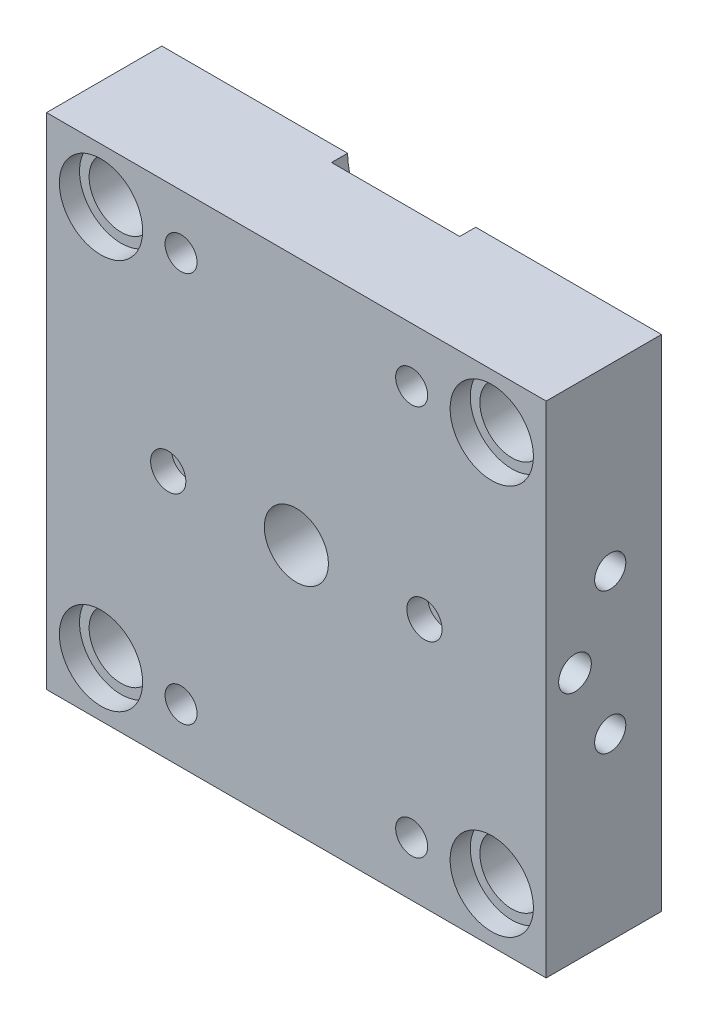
ISO-10303-21;
HEADER;
FILE_DESCRIPTION(('STEP AP214'),'2;1');
FILE_NAME('part.step','',(''),(''),'','','');
FILE_SCHEMA(('AUTOMOTIVE_DESIGN { 1 0 10303 214 1 1 1 1 }'));
ENDSEC;
DATA;
#1=APPLICATION_CONTEXT('core data for automotive mechanical design processes');
#2=APPLICATION_PROTOCOL_DEFINITION('international standard','automotive_design',2000,#1);
#3=PRODUCT_CONTEXT('',#1,'mechanical');
#4=PRODUCT('Part','Part','',(#3));
#5=PRODUCT_RELATED_PRODUCT_CATEGORY('part','',(#4));
#6=PRODUCT_DEFINITION_FORMATION('','',#4);
#7=PRODUCT_DEFINITION_CONTEXT('part definition',#1,'design');
#8=PRODUCT_DEFINITION('design','',#6,#7);
#9=PRODUCT_DEFINITION_SHAPE('','',#8);
#10=(LENGTH_UNIT() NAMED_UNIT(*) SI_UNIT(.MILLI.,.METRE.));
#11=(NAMED_UNIT(*) PLANE_ANGLE_UNIT() SI_UNIT($,.RADIAN.));
#12=(NAMED_UNIT(*) SI_UNIT($,.STERADIAN.) SOLID_ANGLE_UNIT());
#13=UNCERTAINTY_MEASURE_WITH_UNIT(LENGTH_MEASURE(1.E-05),#10,'distance_accuracy_value','');
#14=(GEOMETRIC_REPRESENTATION_CONTEXT(3) GLOBAL_UNCERTAINTY_ASSIGNED_CONTEXT((#13)) GLOBAL_UNIT_ASSIGNED_CONTEXT((#10,
#11,#12)) REPRESENTATION_CONTEXT('',''));
#15=CARTESIAN_POINT('',(0.,0.,0.));
#16=DIRECTION('',(0.,0.,1.));
#17=DIRECTION('',(1.,0.,0.));
#18=AXIS2_PLACEMENT_3D('',#15,#16,#17);
#19=CARTESIAN_POINT('',(40.,0.,36.));
#20=DIRECTION('',(0.,0.,-1.));
#21=DIRECTION('',(-1.,0.,0.));
#22=AXIS2_PLACEMENT_3D('',#19,#20,#21);
#23=CYLINDRICAL_SURFACE('',#22,3.24999999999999);
#24=CARTESIAN_POINT('',(40.,0.,15.));
#25=DIRECTION('',(0.,0.,1.));
#26=DIRECTION('',(1.,0.,0.));
#27=AXIS2_PLACEMENT_3D('',#24,#25,#26);
#28=CIRCLE('',#27,3.24999999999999);
#29=CARTESIAN_POINT('',(43.25,0.,15.));
#30=VERTEX_POINT('',#29);
#31=EDGE_CURVE('E905',#30,#30,#28,.T.);
#32=ORIENTED_EDGE('',*,*,#31,.F.);
#33=EDGE_LOOP('',(#32));
#34=FACE_BOUND('',#33,.T.);
#35=CARTESIAN_POINT('',(40.,0.,29.5));
#36=DIRECTION('',(0.,0.,1.));
#37=DIRECTION('',(1.,0.,0.));
#38=AXIS2_PLACEMENT_3D('',#35,#36,#37);
#39=CIRCLE('',#38,3.24999999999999);
#40=CARTESIAN_POINT('',(43.25,0.,29.5));
#41=VERTEX_POINT('',#40);
#42=EDGE_CURVE('E59',#41,#41,#39,.T.);
#43=ORIENTED_EDGE('',*,*,#42,.T.);
#44=EDGE_LOOP('',(#43));
#45=FACE_BOUND('',#44,.T.);
#46=ADVANCED_FACE('F55',(#34,#45),#23,.F.);
#47=CARTESIAN_POINT('',(-40.,0.,36.));
#48=DIRECTION('',(0.,0.,-1.));
#49=DIRECTION('',(-1.,0.,0.));
#50=AXIS2_PLACEMENT_3D('',#47,#48,#49);
#51=CYLINDRICAL_SURFACE('',#50,3.24999999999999);
#52=CARTESIAN_POINT('',(-40.,0.,15.));
#53=DIRECTION('',(0.,0.,-1.));
#54=DIRECTION('',(-1.,0.,0.));
#55=AXIS2_PLACEMENT_3D('',#52,#53,#54);
#56=CIRCLE('',#55,3.24999999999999);
#57=CARTESIAN_POINT('',(-43.25,0.,15.));
#58=VERTEX_POINT('',#57);
#59=EDGE_CURVE('E302',#58,#58,#56,.T.);
#60=ORIENTED_EDGE('',*,*,#59,.T.);
#61=EDGE_LOOP('',(#60));
#62=FACE_BOUND('',#61,.T.);
#63=CARTESIAN_POINT('',(-40.,0.,29.5));
#64=DIRECTION('',(0.,0.,1.));
#65=DIRECTION('',(1.,0.,0.));
#66=AXIS2_PLACEMENT_3D('',#63,#64,#65);
#67=CIRCLE('',#66,3.24999999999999);
#68=CARTESIAN_POINT('',(-36.75,0.,29.5));
#69=VERTEX_POINT('',#68);
#70=EDGE_CURVE('E300',#69,#69,#67,.F.);
#71=ORIENTED_EDGE('',*,*,#70,.F.);
#72=EDGE_LOOP('',(#71));
#73=FACE_BOUND('',#72,.T.);
#74=ADVANCED_FACE('F422',(#62,#73),#51,.F.);
#75=CARTESIAN_POINT('',(-78.,-78.,36.));
#76=DIRECTION('',(0.,0.,1.));
#77=DIRECTION('',(1.,0.,0.));
#78=AXIS2_PLACEMENT_3D('',#75,#76,#77);
#79=PLANE('',#78);
#80=CARTESIAN_POINT('',(40.,0.,36.));
#81=DIRECTION('',(0.,0.,-1.));
#82=DIRECTION('',(-1.,0.,0.));
#83=AXIS2_PLACEMENT_3D('',#80,#81,#82);
#84=CIRCLE('',#83,5.5);
#85=CARTESIAN_POINT('',(45.5,0.,36.));
#86=VERTEX_POINT('',#85);
#87=EDGE_CURVE('E903',#86,#86,#84,.T.);
#88=ORIENTED_EDGE('',*,*,#87,.T.);
#89=EDGE_LOOP('',(#88));
#90=FACE_BOUND('',#89,.T.);
#91=CARTESIAN_POINT('',(-40.,0.,36.));
#92=DIRECTION('',(0.,0.,1.));
#93=DIRECTION('',(1.,0.,0.));
#94=AXIS2_PLACEMENT_3D('',#91,#92,#93);
#95=CIRCLE('',#94,5.5);
#96=CARTESIAN_POINT('',(-34.5,0.,36.));
#97=VERTEX_POINT('',#96);
#98=EDGE_CURVE('E310',#97,#97,#95,.T.);
#99=ORIENTED_EDGE('',*,*,#98,.F.);
#100=EDGE_LOOP('',(#99));
#101=FACE_BOUND('',#100,.T.);
#102=CARTESIAN_POINT('',(0.,0.,36.));
#103=DIRECTION('',(0.,0.,-1.));
#104=DIRECTION('',(-1.,0.,0.));
#105=AXIS2_PLACEMENT_3D('',#102,#103,#104);
#106=CIRCLE('',#105,10.);
#107=CARTESIAN_POINT('',(-10.,0.,36.));
#108=VERTEX_POINT('',#107);
#109=EDGE_CURVE('E327',#108,#108,#106,.T.);
#110=ORIENTED_EDGE('',*,*,#109,.T.);
#111=EDGE_LOOP('',(#110));
#112=FACE_BOUND('',#111,.T.);
#113=CARTESIAN_POINT('',(-36.,-61.,36.));
#114=DIRECTION('',(0.,0.,1.));
#115=DIRECTION('',(1.,0.,0.));
#116=AXIS2_PLACEMENT_3D('',#113,#114,#115);
#117=CIRCLE('',#116,5.);
#118=CARTESIAN_POINT('',(-31.,-61.,36.));
#119=VERTEX_POINT('',#118);
#120=EDGE_CURVE('E184',#119,#119,#117,.T.);
#121=ORIENTED_EDGE('',*,*,#120,.F.);
#122=EDGE_LOOP('',(#121));
#123=FACE_BOUND('',#122,.T.);
#124=CARTESIAN_POINT('',(36.,61.,36.));
#125=DIRECTION('',(0.,0.,1.));
#126=DIRECTION('',(1.,0.,0.));
#127=AXIS2_PLACEMENT_3D('',#124,#125,#126);
#128=CIRCLE('',#127,5.);
#129=CARTESIAN_POINT('',(41.,61.,36.));
#130=VERTEX_POINT('',#129);
#131=EDGE_CURVE('E228',#130,#130,#128,.T.);
#132=ORIENTED_EDGE('',*,*,#131,.F.);
#133=EDGE_LOOP('',(#132));
#134=FACE_BOUND('',#133,.T.);
#135=DIRECTION('',(0.,-1.,0.));
#136=VECTOR('',#135,1.);
#137=CARTESIAN_POINT('',(-78.,78.,36.));
#138=LINE('',#137,#136);
#139=CARTESIAN_POINT('',(-78.,78.,36.));
#140=VERTEX_POINT('',#139);
#141=CARTESIAN_POINT('',(-78.,-78.,36.));
#142=VERTEX_POINT('',#141);
#143=EDGE_CURVE('E264',#140,#142,#138,.T.);
#144=ORIENTED_EDGE('',*,*,#143,.T.);
#145=DIRECTION('',(1.,0.,0.));
#146=VECTOR('',#145,1.);
#147=CARTESIAN_POINT('',(-78.,-78.,36.));
#148=LINE('',#147,#146);
#149=CARTESIAN_POINT('',(78.,-78.,36.));
#150=VERTEX_POINT('',#149);
#151=EDGE_CURVE('E267',#142,#150,#148,.T.);
#152=ORIENTED_EDGE('',*,*,#151,.T.);
#153=DIRECTION('',(0.,1.,0.));
#154=VECTOR('',#153,1.);
#155=CARTESIAN_POINT('',(78.,78.,36.));
#156=LINE('',#155,#154);
#157=CARTESIAN_POINT('',(78.,78.,36.));
#158=VERTEX_POINT('',#157);
#159=EDGE_CURVE('E270',#150,#158,#156,.T.);
#160=ORIENTED_EDGE('',*,*,#159,.T.);
#161=DIRECTION('',(-1.,0.,0.));
#162=VECTOR('',#161,1.);
#163=CARTESIAN_POINT('',(-78.,78.,36.));
#164=LINE('',#163,#162);
#165=EDGE_CURVE('E272',#158,#140,#164,.T.);
#166=ORIENTED_EDGE('',*,*,#165,.T.);
#167=EDGE_LOOP('',(#144,#152,#160,#166));
#168=FACE_BOUND('',#167,.T.);
#169=CARTESIAN_POINT('',(-61.,61.,36.));
#170=DIRECTION('',(0.,0.,1.));
#171=DIRECTION('',(1.,0.,0.));
#172=AXIS2_PLACEMENT_3D('',#169,#170,#171);
#173=CIRCLE('',#172,13.);
#174=CARTESIAN_POINT('',(-48.,61.,36.));
#175=VERTEX_POINT('',#174);
#176=EDGE_CURVE('E253',#175,#175,#173,.T.);
#177=ORIENTED_EDGE('',*,*,#176,.F.);
#178=EDGE_LOOP('',(#177));
#179=FACE_BOUND('',#178,.T.);
#180=CARTESIAN_POINT('',(-36.,61.,36.));
#181=DIRECTION('',(0.,0.,1.));
#182=DIRECTION('',(1.,0.,0.));
#183=AXIS2_PLACEMENT_3D('',#180,#181,#182);
#184=CIRCLE('',#183,5.);
#185=CARTESIAN_POINT('',(-31.,61.,36.));
#186=VERTEX_POINT('',#185);
#187=EDGE_CURVE('E250',#186,#186,#184,.T.);
#188=ORIENTED_EDGE('',*,*,#187,.F.);
#189=EDGE_LOOP('',(#188));
#190=FACE_BOUND('',#189,.T.);
#191=CARTESIAN_POINT('',(61.,61.,36.));
#192=DIRECTION('',(0.,0.,-1.));
#193=DIRECTION('',(-1.,0.,0.));
#194=AXIS2_PLACEMENT_3D('',#191,#192,#193);
#195=CIRCLE('',#194,13.);
#196=CARTESIAN_POINT('',(48.,61.,36.));
#197=VERTEX_POINT('',#196);
#198=EDGE_CURVE('E231',#197,#197,#195,.T.);
#199=ORIENTED_EDGE('',*,*,#198,.T.);
#200=EDGE_LOOP('',(#199));
#201=FACE_BOUND('',#200,.T.);
#202=CARTESIAN_POINT('',(61.,-61.,36.));
#203=DIRECTION('',(0.,0.,1.));
#204=DIRECTION('',(-1.,0.,0.));
#205=AXIS2_PLACEMENT_3D('',#202,#203,#204);
#206=CIRCLE('',#205,13.);
#207=CARTESIAN_POINT('',(48.,-61.,36.));
#208=VERTEX_POINT('',#207);
#209=EDGE_CURVE('E209',#208,#208,#206,.T.);
#210=ORIENTED_EDGE('',*,*,#209,.F.);
#211=EDGE_LOOP('',(#210));
#212=FACE_BOUND('',#211,.T.);
#213=CARTESIAN_POINT('',(36.,-61.,36.));
#214=DIRECTION('',(0.,0.,1.));
#215=DIRECTION('',(1.,0.,0.));
#216=AXIS2_PLACEMENT_3D('',#213,#214,#215);
#217=CIRCLE('',#216,5.);
#218=CARTESIAN_POINT('',(41.,-61.,36.));
#219=VERTEX_POINT('',#218);
#220=EDGE_CURVE('E206',#219,#219,#217,.T.);
#221=ORIENTED_EDGE('',*,*,#220,.F.);
#222=EDGE_LOOP('',(#221));
#223=FACE_BOUND('',#222,.T.);
#224=CARTESIAN_POINT('',(-61.,-61.,36.));
#225=DIRECTION('',(0.,0.,-1.));
#226=DIRECTION('',(1.,0.,0.));
#227=AXIS2_PLACEMENT_3D('',#224,#225,#226);
#228=CIRCLE('',#227,13.);
#229=CARTESIAN_POINT('',(-48.,-61.,36.));
#230=VERTEX_POINT('',#229);
#231=EDGE_CURVE('E187',#230,#230,#228,.T.);
#232=ORIENTED_EDGE('',*,*,#231,.T.);
#233=EDGE_LOOP('',(#232));
#234=FACE_BOUND('',#233,.T.);
#235=ADVANCED_FACE('F395',(#90,#101,#112,#123,#134,#168,#179,#190,#201,#212,#223,#234),#79,.T.);
#236=CARTESIAN_POINT('',(-61.,-61.,36.));
#237=DIRECTION('',(0.,0.,-1.));
#238=DIRECTION('',(-1.,0.,0.));
#239=AXIS2_PLACEMENT_3D('',#236,#237,#238);
#240=CYLINDRICAL_SURFACE('',#239,10.);
#241=CARTESIAN_POINT('',(-61.,-61.,0.));
#242=DIRECTION('',(0.,0.,-1.));
#243=DIRECTION('',(1.,0.,0.));
#244=AXIS2_PLACEMENT_3D('',#241,#242,#243);
#245=CIRCLE('',#244,10.);
#246=CARTESIAN_POINT('',(-51.,-61.,0.));
#247=VERTEX_POINT('',#246);
#248=EDGE_CURVE('E194',#247,#247,#245,.T.);
#249=ORIENTED_EDGE('',*,*,#248,.T.);
#250=EDGE_LOOP('',(#249));
#251=FACE_BOUND('',#250,.T.);
#252=CARTESIAN_POINT('',(-61.,-61.,29.7));
#253=DIRECTION('',(0.,0.,1.));
#254=DIRECTION('',(1.,0.,0.));
#255=AXIS2_PLACEMENT_3D('',#252,#253,#254);
#256=CIRCLE('',#255,10.);
#257=CARTESIAN_POINT('',(-51.,-61.,29.7));
#258=VERTEX_POINT('',#257);
#259=EDGE_CURVE('E191',#258,#258,#256,.F.);
#260=ORIENTED_EDGE('',*,*,#259,.F.);
#261=EDGE_LOOP('',(#260));
#262=FACE_BOUND('',#261,.T.);
#263=ADVANCED_FACE('F526',(#251,#262),#240,.F.);
#264=CARTESIAN_POINT('',(61.,-61.,36.));
#265=DIRECTION('',(0.,0.,-1.));
#266=DIRECTION('',(-1.,0.,0.));
#267=AXIS2_PLACEMENT_3D('',#264,#265,#266);
#268=CYLINDRICAL_SURFACE('',#267,10.);
#269=CARTESIAN_POINT('',(61.,-61.,0.));
#270=DIRECTION('',(0.,0.,1.));
#271=DIRECTION('',(-1.,0.,0.));
#272=AXIS2_PLACEMENT_3D('',#269,#270,#271);
#273=CIRCLE('',#272,10.);
#274=CARTESIAN_POINT('',(51.,-61.,0.));
#275=VERTEX_POINT('',#274);
#276=EDGE_CURVE('E216',#275,#275,#273,.T.);
#277=ORIENTED_EDGE('',*,*,#276,.F.);
#278=EDGE_LOOP('',(#277));
#279=FACE_BOUND('',#278,.T.);
#280=CARTESIAN_POINT('',(61.,-61.,29.7));
#281=DIRECTION('',(0.,0.,1.));
#282=DIRECTION('',(1.,0.,0.));
#283=AXIS2_PLACEMENT_3D('',#280,#281,#282);
#284=CIRCLE('',#283,10.);
#285=CARTESIAN_POINT('',(71.,-61.,29.7));
#286=VERTEX_POINT('',#285);
#287=EDGE_CURVE('E213',#286,#286,#284,.T.);
#288=ORIENTED_EDGE('',*,*,#287,.T.);
#289=EDGE_LOOP('',(#288));
#290=FACE_BOUND('',#289,.T.);
#291=ADVANCED_FACE('F522',(#279,#290),#268,.F.);
#292=CARTESIAN_POINT('',(-78.,-78.,0.));
#293=DIRECTION('',(0.,0.,1.));
#294=DIRECTION('',(1.,0.,0.));
#295=AXIS2_PLACEMENT_3D('',#292,#293,#294);
#296=PLANE('',#295);
#297=CARTESIAN_POINT('',(40.,0.,0.));
#298=DIRECTION('',(0.,0.,1.));
#299=DIRECTION('',(1.,0.,0.));
#300=AXIS2_PLACEMENT_3D('',#297,#298,#299);
#301=CIRCLE('',#300,6.5);
#302=CARTESIAN_POINT('',(46.5,0.,0.));
#303=VERTEX_POINT('',#302);
#304=EDGE_CURVE('E318',#303,#303,#301,.T.);
#305=ORIENTED_EDGE('',*,*,#304,.T.);
#306=EDGE_LOOP('',(#305));
#307=FACE_BOUND('',#306,.T.);
#308=CARTESIAN_POINT('',(-40.,0.,0.));
#309=DIRECTION('',(0.,0.,-1.));
#310=DIRECTION('',(-1.,0.,0.));
#311=AXIS2_PLACEMENT_3D('',#308,#309,#310);
#312=CIRCLE('',#311,6.5);
#313=CARTESIAN_POINT('',(-46.5,0.,0.));
#314=VERTEX_POINT('',#313);
#315=EDGE_CURVE('E307',#314,#314,#312,.T.);
#316=ORIENTED_EDGE('',*,*,#315,.F.);
#317=EDGE_LOOP('',(#316));
#318=FACE_BOUND('',#317,.T.);
#319=CARTESIAN_POINT('',(0.,0.,0.));
#320=DIRECTION('',(0.,0.,-1.));
#321=DIRECTION('',(-1.,0.,0.));
#322=AXIS2_PLACEMENT_3D('',#319,#320,#321);
#323=CIRCLE('',#322,10.);
#324=CARTESIAN_POINT('',(-10.,0.,0.));
#325=VERTEX_POINT('',#324);
#326=EDGE_CURVE('E324',#325,#325,#323,.T.);
#327=ORIENTED_EDGE('',*,*,#326,.F.);
#328=EDGE_LOOP('',(#327));
#329=FACE_BOUND('',#328,.T.);
#330=ORIENTED_EDGE('',*,*,#248,.F.);
#331=EDGE_LOOP('',(#330));
#332=FACE_BOUND('',#331,.T.);
#333=CARTESIAN_POINT('',(61.,61.,0.));
#334=DIRECTION('',(0.,0.,-1.));
#335=DIRECTION('',(-1.,0.,0.));
#336=AXIS2_PLACEMENT_3D('',#333,#334,#335);
#337=CIRCLE('',#336,10.);
#338=CARTESIAN_POINT('',(51.,61.,0.));
#339=VERTEX_POINT('',#338);
#340=EDGE_CURVE('E238',#339,#339,#337,.T.);
#341=ORIENTED_EDGE('',*,*,#340,.F.);
#342=EDGE_LOOP('',(#341));
#343=FACE_BOUND('',#342,.T.);
#344=DIRECTION('',(1.,0.,0.));
#345=VECTOR('',#344,1.);
#346=CARTESIAN_POINT('',(-78.,-78.,0.));
#347=LINE('',#346,#345);
#348=CARTESIAN_POINT('',(20.,-78.,0.));
#349=VERTEX_POINT('',#348);
#350=CARTESIAN_POINT('',(78.,-78.,0.));
#351=VERTEX_POINT('',#350);
#352=EDGE_CURVE('E277',#349,#351,#347,.T.);
#353=ORIENTED_EDGE('',*,*,#352,.F.);
#354=CARTESIAN_POINT('',(0.,-78.,0.));
#355=DIRECTION('',(0.,0.,-1.));
#356=DIRECTION('',(-1.,0.,0.));
#357=AXIS2_PLACEMENT_3D('',#354,#355,#356);
#358=CIRCLE('',#357,20.);
#359=CARTESIAN_POINT('',(-20.,-78.,0.));
#360=VERTEX_POINT('',#359);
#361=EDGE_CURVE('E149',#360,#349,#358,.T.);
#362=ORIENTED_EDGE('',*,*,#361,.F.);
#363=CARTESIAN_POINT('',(-78.,-78.,0.));
#364=VERTEX_POINT('',#363);
#365=EDGE_CURVE('E278',#364,#360,#347,.T.);
#366=ORIENTED_EDGE('',*,*,#365,.F.);
#367=DIRECTION('',(0.,-1.,0.));
#368=VECTOR('',#367,1.);
#369=CARTESIAN_POINT('',(-78.,78.,0.));
#370=LINE('',#369,#368);
#371=CARTESIAN_POINT('',(-78.,78.,0.));
#372=VERTEX_POINT('',#371);
#373=EDGE_CURVE('E263',#372,#364,#370,.T.);
#374=ORIENTED_EDGE('',*,*,#373,.F.);
#375=DIRECTION('',(-1.,0.,0.));
#376=VECTOR('',#375,1.);
#377=CARTESIAN_POINT('',(-78.,78.,0.));
#378=LINE('',#377,#376);
#379=CARTESIAN_POINT('',(-20.,78.,0.));
#380=VERTEX_POINT('',#379);
#381=EDGE_CURVE('E283',#380,#372,#378,.T.);
#382=ORIENTED_EDGE('',*,*,#381,.F.);
#383=CARTESIAN_POINT('',(0.,78.,0.));
#384=DIRECTION('',(0.,0.,-1.));
#385=DIRECTION('',(-1.,0.,0.));
#386=AXIS2_PLACEMENT_3D('',#383,#384,#385);
#387=CIRCLE('',#386,20.);
#388=CARTESIAN_POINT('',(20.,78.,0.));
#389=VERTEX_POINT('',#388);
#390=EDGE_CURVE('E163',#389,#380,#387,.T.);
#391=ORIENTED_EDGE('',*,*,#390,.F.);
#392=CARTESIAN_POINT('',(78.,78.,0.));
#393=VERTEX_POINT('',#392);
#394=EDGE_CURVE('E268',#393,#389,#378,.T.);
#395=ORIENTED_EDGE('',*,*,#394,.F.);
#396=DIRECTION('',(0.,1.,0.));
#397=VECTOR('',#396,1.);
#398=CARTESIAN_POINT('',(78.,78.,0.));
#399=LINE('',#398,#397);
#400=EDGE_CURVE('E281',#351,#393,#399,.T.);
#401=ORIENTED_EDGE('',*,*,#400,.F.);
#402=EDGE_LOOP('',(#353,#362,#366,#374,#382,#391,#395,#401));
#403=FACE_BOUND('',#402,.T.);
#404=CARTESIAN_POINT('',(-61.,61.,0.));
#405=DIRECTION('',(0.,0.,1.));
#406=DIRECTION('',(1.,0.,0.));
#407=AXIS2_PLACEMENT_3D('',#404,#405,#406);
#408=CIRCLE('',#407,10.);
#409=CARTESIAN_POINT('',(-51.,61.,0.));
#410=VERTEX_POINT('',#409);
#411=EDGE_CURVE('E260',#410,#410,#408,.T.);
#412=ORIENTED_EDGE('',*,*,#411,.T.);
#413=EDGE_LOOP('',(#412));
#414=FACE_BOUND('',#413,.T.);
#415=ORIENTED_EDGE('',*,*,#276,.T.);
#416=EDGE_LOOP('',(#415));
#417=FACE_BOUND('',#416,.T.);
#418=ADVANCED_FACE('F385',(#307,#318,#329,#332,#343,#403,#414,#417),#296,.F.);
#419=CARTESIAN_POINT('',(61.,61.,36.));
#420=DIRECTION('',(0.,0.,-1.));
#421=DIRECTION('',(-1.,0.,0.));
#422=AXIS2_PLACEMENT_3D('',#419,#420,#421);
#423=CYLINDRICAL_SURFACE('',#422,10.);
#424=ORIENTED_EDGE('',*,*,#340,.T.);
#425=EDGE_LOOP('',(#424));
#426=FACE_BOUND('',#425,.T.);
#427=CARTESIAN_POINT('',(61.,61.,29.7));
#428=DIRECTION('',(0.,0.,1.));
#429=DIRECTION('',(1.,0.,0.));
#430=AXIS2_PLACEMENT_3D('',#427,#428,#429);
#431=CIRCLE('',#430,10.);
#432=CARTESIAN_POINT('',(71.,61.,29.7));
#433=VERTEX_POINT('',#432);
#434=EDGE_CURVE('E235',#433,#433,#431,.F.);
#435=ORIENTED_EDGE('',*,*,#434,.F.);
#436=EDGE_LOOP('',(#435));
#437=FACE_BOUND('',#436,.T.);
#438=ADVANCED_FACE('F521',(#426,#437),#423,.F.);
#439=CARTESIAN_POINT('',(-61.,61.,36.));
#440=DIRECTION('',(0.,0.,-1.));
#441=DIRECTION('',(-1.,0.,0.));
#442=AXIS2_PLACEMENT_3D('',#439,#440,#441);
#443=CYLINDRICAL_SURFACE('',#442,10.);
#444=ORIENTED_EDGE('',*,*,#411,.F.);
#445=EDGE_LOOP('',(#444));
#446=FACE_BOUND('',#445,.T.);
#447=CARTESIAN_POINT('',(-61.,61.,29.7));
#448=DIRECTION('',(0.,0.,1.));
#449=DIRECTION('',(1.,0.,0.));
#450=AXIS2_PLACEMENT_3D('',#447,#448,#449);
#451=CIRCLE('',#450,10.);
#452=CARTESIAN_POINT('',(-51.,61.,29.7));
#453=VERTEX_POINT('',#452);
#454=EDGE_CURVE('E257',#453,#453,#451,.T.);
#455=ORIENTED_EDGE('',*,*,#454,.T.);
#456=EDGE_LOOP('',(#455));
#457=FACE_BOUND('',#456,.T.);
#458=ADVANCED_FACE('F376',(#446,#457),#443,.F.);
#459=CARTESIAN_POINT('',(-78.,78.,36.));
#460=DIRECTION('',(1.,0.,0.));
#461=DIRECTION('',(0.,1.,0.));
#462=AXIS2_PLACEMENT_3D('',#459,#460,#461);
#463=PLANE('',#462);
#464=CARTESIAN_POINT('',(-78.,22.,16.));
#465=DIRECTION('',(-1.,0.,0.));
#466=DIRECTION('',(0.,0.,1.));
#467=AXIS2_PLACEMENT_3D('',#464,#465,#466);
#468=CIRCLE('',#467,4.864);
#469=CARTESIAN_POINT('',(-78.,22.,20.864));
#470=VERTEX_POINT('',#469);
#471=EDGE_CURVE('E350',#470,#470,#468,.T.);
#472=ORIENTED_EDGE('',*,*,#471,.F.);
#473=EDGE_LOOP('',(#472));
#474=FACE_BOUND('',#473,.T.);
#475=CARTESIAN_POINT('',(-78.,-22.,16.));
#476=DIRECTION('',(-1.,0.,0.));
#477=DIRECTION('',(0.,0.,1.));
#478=AXIS2_PLACEMENT_3D('',#475,#476,#477);
#479=CIRCLE('',#478,4.864);
#480=CARTESIAN_POINT('',(-78.,-22.,20.864));
#481=VERTEX_POINT('',#480);
#482=EDGE_CURVE('E359',#481,#481,#479,.T.);
#483=ORIENTED_EDGE('',*,*,#482,.F.);
#484=EDGE_LOOP('',(#483));
#485=FACE_BOUND('',#484,.T.);
#486=ORIENTED_EDGE('',*,*,#373,.T.);
#487=DIRECTION('',(0.,0.,-1.));
#488=VECTOR('',#487,1.);
#489=CARTESIAN_POINT('',(-78.,-78.,36.));
#490=LINE('',#489,#488);
#491=EDGE_CURVE('E13',#142,#364,#490,.T.);
#492=ORIENTED_EDGE('',*,*,#491,.F.);
#493=ORIENTED_EDGE('',*,*,#143,.F.);
#494=DIRECTION('',(0.,0.,-1.));
#495=VECTOR('',#494,1.);
#496=CARTESIAN_POINT('',(-78.,78.,36.));
#497=LINE('',#496,#495);
#498=EDGE_CURVE('E274',#140,#372,#497,.T.);
#499=ORIENTED_EDGE('',*,*,#498,.T.);
#500=EDGE_LOOP('',(#486,#492,#493,#499));
#501=FACE_BOUND('',#500,.T.);
#502=ADVANCED_FACE('F57',(#474,#485,#501),#463,.F.);
#503=CARTESIAN_POINT('',(-78.,-78.,36.));
#504=DIRECTION('',(0.,1.,0.));
#505=DIRECTION('',(0.,0.,1.));
#506=AXIS2_PLACEMENT_3D('',#503,#504,#505);
#507=PLANE('',#506);
#508=DIRECTION('',(-1.,0.,0.));
#509=VECTOR('',#508,1.);
#510=CARTESIAN_POINT('',(20.,-78.,5.));
#511=LINE('',#510,#509);
#512=CARTESIAN_POINT('',(20.,-78.,5.));
#513=VERTEX_POINT('',#512);
#514=CARTESIAN_POINT('',(-20.,-78.,5.));
#515=VERTEX_POINT('',#514);
#516=EDGE_CURVE('E157',#513,#515,#511,.T.);
#517=ORIENTED_EDGE('',*,*,#516,.F.);
#518=DIRECTION('',(0.,0.,-1.));
#519=VECTOR('',#518,1.);
#520=CARTESIAN_POINT('',(20.,-78.,5.));
#521=LINE('',#520,#519);
#522=EDGE_CURVE('E159',#513,#349,#521,.T.);
#523=ORIENTED_EDGE('',*,*,#522,.T.);
#524=ORIENTED_EDGE('',*,*,#352,.T.);
#525=DIRECTION('',(0.,0.,-1.));
#526=VECTOR('',#525,1.);
#527=CARTESIAN_POINT('',(78.,-78.,36.));
#528=LINE('',#527,#526);
#529=EDGE_CURVE('E64',#150,#351,#528,.T.);
#530=ORIENTED_EDGE('',*,*,#529,.F.);
#531=ORIENTED_EDGE('',*,*,#151,.F.);
#532=ORIENTED_EDGE('',*,*,#491,.T.);
#533=ORIENTED_EDGE('',*,*,#365,.T.);
#534=DIRECTION('',(0.,0.,-1.));
#535=VECTOR('',#534,1.);
#536=CARTESIAN_POINT('',(-20.,-78.,5.));
#537=LINE('',#536,#535);
#538=EDGE_CURVE('E161',#515,#360,#537,.T.);
#539=ORIENTED_EDGE('',*,*,#538,.F.);
#540=EDGE_LOOP('',(#517,#523,#524,#530,#531,#532,#533,#539));
#541=FACE_BOUND('',#540,.T.);
#542=ADVANCED_FACE('F375',(#541),#507,.F.);
#543=CARTESIAN_POINT('',(78.,78.,36.));
#544=DIRECTION('',(-1.,0.,0.));
#545=DIRECTION('',(0.,0.,1.));
#546=AXIS2_PLACEMENT_3D('',#543,#544,#545);
#547=PLANE('',#546);
#548=CARTESIAN_POINT('',(78.,22.,16.));
#549=DIRECTION('',(1.,0.,0.));
#550=DIRECTION('',(0.,0.,-1.));
#551=AXIS2_PLACEMENT_3D('',#548,#549,#550);
#552=CIRCLE('',#551,4.864);
#553=CARTESIAN_POINT('',(78.,22.,11.136));
#554=VERTEX_POINT('',#553);
#555=EDGE_CURVE('E330',#554,#554,#552,.T.);
#556=ORIENTED_EDGE('',*,*,#555,.F.);
#557=EDGE_LOOP('',(#556));
#558=FACE_BOUND('',#557,.T.);
#559=CARTESIAN_POINT('',(78.,-22.,16.));
#560=DIRECTION('',(1.,0.,0.));
#561=DIRECTION('',(0.,0.,-1.));
#562=AXIS2_PLACEMENT_3D('',#559,#560,#561);
#563=CIRCLE('',#562,4.864);
#564=CARTESIAN_POINT('',(78.,-22.,11.136));
#565=VERTEX_POINT('',#564);
#566=EDGE_CURVE('E341',#565,#565,#563,.T.);
#567=ORIENTED_EDGE('',*,*,#566,.F.);
#568=EDGE_LOOP('',(#567));
#569=FACE_BOUND('',#568,.T.);
#570=CARTESIAN_POINT('',(78.,0.,27.));
#571=DIRECTION('',(1.,0.,0.));
#572=DIRECTION('',(0.,0.,-1.));
#573=AXIS2_PLACEMENT_3D('',#570,#571,#572);
#574=CIRCLE('',#573,5.09999999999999);
#575=CARTESIAN_POINT('',(78.,0.,21.9));
#576=VERTEX_POINT('',#575);
#577=EDGE_CURVE('E145',#576,#576,#574,.T.);
#578=ORIENTED_EDGE('',*,*,#577,.F.);
#579=EDGE_LOOP('',(#578));
#580=FACE_BOUND('',#579,.T.);
#581=ORIENTED_EDGE('',*,*,#400,.T.);
#582=DIRECTION('',(0.,0.,-1.));
#583=VECTOR('',#582,1.);
#584=CARTESIAN_POINT('',(78.,78.,36.));
#585=LINE('',#584,#583);
#586=EDGE_CURVE('E288',#158,#393,#585,.T.);
#587=ORIENTED_EDGE('',*,*,#586,.F.);
#588=ORIENTED_EDGE('',*,*,#159,.F.);
#589=ORIENTED_EDGE('',*,*,#529,.T.);
#590=EDGE_LOOP('',(#581,#587,#588,#589));
#591=FACE_BOUND('',#590,.T.);
#592=ADVANCED_FACE('F408',(#558,#569,#580,#591),#547,.F.);
#593=CARTESIAN_POINT('',(-78.,78.,36.));
#594=DIRECTION('',(0.,-1.,0.));
#595=DIRECTION('',(0.,0.,-1.));
#596=AXIS2_PLACEMENT_3D('',#593,#594,#595);
#597=PLANE('',#596);
#598=DIRECTION('',(1.,0.,0.));
#599=VECTOR('',#598,1.);
#600=CARTESIAN_POINT('',(20.,78.,5.));
#601=LINE('',#600,#599);
#602=CARTESIAN_POINT('',(-20.,78.,5.));
#603=VERTEX_POINT('',#602);
#604=CARTESIAN_POINT('',(20.,78.,5.));
#605=VERTEX_POINT('',#604);
#606=EDGE_CURVE('E167',#603,#605,#601,.T.);
#607=ORIENTED_EDGE('',*,*,#606,.F.);
#608=DIRECTION('',(0.,0.,-1.));
#609=VECTOR('',#608,1.);
#610=CARTESIAN_POINT('',(-20.,78.,5.));
#611=LINE('',#610,#609);
#612=EDGE_CURVE('E169',#603,#380,#611,.T.);
#613=ORIENTED_EDGE('',*,*,#612,.T.);
#614=ORIENTED_EDGE('',*,*,#381,.T.);
#615=ORIENTED_EDGE('',*,*,#498,.F.);
#616=ORIENTED_EDGE('',*,*,#165,.F.);
#617=ORIENTED_EDGE('',*,*,#586,.T.);
#618=ORIENTED_EDGE('',*,*,#394,.T.);
#619=DIRECTION('',(0.,0.,-1.));
#620=VECTOR('',#619,1.);
#621=CARTESIAN_POINT('',(20.,78.,5.));
#622=LINE('',#621,#620);
#623=EDGE_CURVE('E171',#605,#389,#622,.T.);
#624=ORIENTED_EDGE('',*,*,#623,.F.);
#625=EDGE_LOOP('',(#607,#613,#614,#615,#616,#617,#618,#624));
#626=FACE_BOUND('',#625,.T.);
#627=ADVANCED_FACE('F401',(#626),#597,.F.);
#628=CARTESIAN_POINT('',(-61.,61.,29.7));
#629=DIRECTION('',(0.,0.,1.));
#630=DIRECTION('',(1.,0.,0.));
#631=AXIS2_PLACEMENT_3D('',#628,#629,#630);
#632=CYLINDRICAL_SURFACE('',#631,13.);
#633=CARTESIAN_POINT('',(-61.,61.,29.7));
#634=DIRECTION('',(0.,0.,1.));
#635=DIRECTION('',(1.,0.,0.));
#636=AXIS2_PLACEMENT_3D('',#633,#634,#635);
#637=CIRCLE('',#636,13.);
#638=CARTESIAN_POINT('',(-48.,61.,29.7));
#639=VERTEX_POINT('',#638);
#640=EDGE_CURVE('E254',#639,#639,#637,.T.);
#641=ORIENTED_EDGE('',*,*,#640,.F.);
#642=EDGE_LOOP('',(#641));
#643=FACE_BOUND('',#642,.T.);
#644=ORIENTED_EDGE('',*,*,#176,.T.);
#645=EDGE_LOOP('',(#644));
#646=FACE_BOUND('',#645,.T.);
#647=ADVANCED_FACE('F515',(#643,#646),#632,.F.);
#648=CARTESIAN_POINT('',(-61.,61.,29.7));
#649=DIRECTION('',(0.,0.,1.));
#650=DIRECTION('',(1.,0.,0.));
#651=AXIS2_PLACEMENT_3D('',#648,#649,#650);
#652=PLANE('',#651);
#653=ORIENTED_EDGE('',*,*,#454,.F.);
#654=EDGE_LOOP('',(#653));
#655=FACE_BOUND('',#654,.T.);
#656=ORIENTED_EDGE('',*,*,#640,.T.);
#657=EDGE_LOOP('',(#656));
#658=FACE_BOUND('',#657,.T.);
#659=ADVANCED_FACE('F533',(#655,#658),#652,.T.);
#660=CARTESIAN_POINT('',(-36.,61.,36.));
#661=DIRECTION('',(0.,0.,1.));
#662=DIRECTION('',(1.,0.,0.));
#663=AXIS2_PLACEMENT_3D('',#660,#661,#662);
#664=CYLINDRICAL_SURFACE('',#663,5.);
#665=CARTESIAN_POINT('',(-36.,61.,21.));
#666=DIRECTION('',(0.,0.,1.));
#667=DIRECTION('',(1.,0.,0.));
#668=AXIS2_PLACEMENT_3D('',#665,#666,#667);
#669=CIRCLE('',#668,5.);
#670=CARTESIAN_POINT('',(-31.,61.,21.));
#671=VERTEX_POINT('',#670);
#672=EDGE_CURVE('E247',#671,#671,#669,.T.);
#673=ORIENTED_EDGE('',*,*,#672,.F.);
#674=EDGE_LOOP('',(#673));
#675=FACE_BOUND('',#674,.T.);
#676=ORIENTED_EDGE('',*,*,#187,.T.);
#677=EDGE_LOOP('',(#676));
#678=FACE_BOUND('',#677,.T.);
#679=ADVANCED_FACE('F537',(#675,#678),#664,.F.);
#680=CARTESIAN_POINT('',(-31.75,61.,21.));
#681=DIRECTION('',(0.,0.,-1.));
#682=DIRECTION('',(-1.,0.,0.));
#683=AXIS2_PLACEMENT_3D('',#680,#681,#682);
#684=PLANE('',#683);
#685=CARTESIAN_POINT('',(-36.,61.,21.));
#686=DIRECTION('',(0.,0.,1.));
#687=DIRECTION('',(1.,0.,0.));
#688=AXIS2_PLACEMENT_3D('',#685,#686,#687);
#689=CIRCLE('',#688,4.25);
#690=CARTESIAN_POINT('',(-31.75,61.,21.));
#691=VERTEX_POINT('',#690);
#692=EDGE_CURVE('E244',#691,#691,#689,.T.);
#693=ORIENTED_EDGE('',*,*,#692,.F.);
#694=EDGE_LOOP('',(#693));
#695=FACE_BOUND('',#694,.T.);
#696=ORIENTED_EDGE('',*,*,#672,.T.);
#697=EDGE_LOOP('',(#696));
#698=FACE_BOUND('',#697,.T.);
#699=ADVANCED_FACE('F541',(#695,#698),#684,.F.);
#700=CARTESIAN_POINT('',(-36.,61.,36.));
#701=DIRECTION('',(0.,0.,1.));
#702=DIRECTION('',(1.,0.,0.));
#703=AXIS2_PLACEMENT_3D('',#700,#701,#702);
#704=CYLINDRICAL_SURFACE('',#703,4.25);
#705=CARTESIAN_POINT('',(-36.,61.,16.));
#706=DIRECTION('',(0.,0.,1.));
#707=DIRECTION('',(1.,0.,0.));
#708=AXIS2_PLACEMENT_3D('',#705,#706,#707);
#709=CIRCLE('',#708,4.25);
#710=CARTESIAN_POINT('',(-31.75,61.,16.));
#711=VERTEX_POINT('',#710);
#712=EDGE_CURVE('E241',#711,#711,#709,.T.);
#713=ORIENTED_EDGE('',*,*,#712,.F.);
#714=EDGE_LOOP('',(#713));
#715=FACE_BOUND('',#714,.T.);
#716=ORIENTED_EDGE('',*,*,#692,.T.);
#717=EDGE_LOOP('',(#716));
#718=FACE_BOUND('',#717,.T.);
#719=ADVANCED_FACE('F545',(#715,#718),#704,.F.);
#720=CARTESIAN_POINT('',(-36.,61.,16.));
#721=DIRECTION('',(0.,0.,1.));
#722=DIRECTION('',(1.,0.,0.));
#723=AXIS2_PLACEMENT_3D('',#720,#721,#722);
#724=CONICAL_SURFACE('',#723,4.25,1.02974425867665);
#725=CARTESIAN_POINT('',(-36.,61.,13.4463423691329));
#726=VERTEX_POINT('',#725);
#727=VERTEX_LOOP('',#726);
#728=FACE_BOUND('',#727,.T.);
#729=ORIENTED_EDGE('',*,*,#712,.T.);
#730=EDGE_LOOP('',(#729));
#731=FACE_BOUND('',#730,.T.);
#732=ADVANCED_FACE('F549',(#728,#731),#724,.F.);
#733=CARTESIAN_POINT('',(61.,61.,29.7));
#734=DIRECTION('',(0.,0.,1.));
#735=DIRECTION('',(-1.,0.,0.));
#736=AXIS2_PLACEMENT_3D('',#733,#734,#735);
#737=PLANE('',#736);
#738=CARTESIAN_POINT('',(61.,61.,29.7));
#739=DIRECTION('',(0.,0.,-1.));
#740=DIRECTION('',(-1.,0.,0.));
#741=AXIS2_PLACEMENT_3D('',#738,#739,#740);
#742=CIRCLE('',#741,13.);
#743=CARTESIAN_POINT('',(48.,61.,29.7));
#744=VERTEX_POINT('',#743);
#745=EDGE_CURVE('E232',#744,#744,#742,.T.);
#746=ORIENTED_EDGE('',*,*,#745,.F.);
#747=EDGE_LOOP('',(#746));
#748=FACE_BOUND('',#747,.T.);
#749=ORIENTED_EDGE('',*,*,#434,.T.);
#750=EDGE_LOOP('',(#749));
#751=FACE_BOUND('',#750,.T.);
#752=ADVANCED_FACE('F553',(#748,#751),#737,.T.);
#753=CARTESIAN_POINT('',(61.,61.,29.7));
#754=DIRECTION('',(0.,0.,1.));
#755=DIRECTION('',(1.,0.,0.));
#756=AXIS2_PLACEMENT_3D('',#753,#754,#755);
#757=CYLINDRICAL_SURFACE('',#756,13.);
#758=ORIENTED_EDGE('',*,*,#745,.T.);
#759=EDGE_LOOP('',(#758));
#760=FACE_BOUND('',#759,.T.);
#761=ORIENTED_EDGE('',*,*,#198,.F.);
#762=EDGE_LOOP('',(#761));
#763=FACE_BOUND('',#762,.T.);
#764=ADVANCED_FACE('F558',(#760,#763),#757,.F.);
#765=CARTESIAN_POINT('',(36.,61.,36.));
#766=DIRECTION('',(0.,0.,1.));
#767=DIRECTION('',(1.,0.,0.));
#768=AXIS2_PLACEMENT_3D('',#765,#766,#767);
#769=CYLINDRICAL_SURFACE('',#768,5.);
#770=CARTESIAN_POINT('',(36.,61.,21.));
#771=DIRECTION('',(0.,0.,1.));
#772=DIRECTION('',(1.,0.,0.));
#773=AXIS2_PLACEMENT_3D('',#770,#771,#772);
#774=CIRCLE('',#773,5.);
#775=CARTESIAN_POINT('',(41.,61.,21.));
#776=VERTEX_POINT('',#775);
#777=EDGE_CURVE('E225',#776,#776,#774,.T.);
#778=ORIENTED_EDGE('',*,*,#777,.F.);
#779=EDGE_LOOP('',(#778));
#780=FACE_BOUND('',#779,.T.);
#781=ORIENTED_EDGE('',*,*,#131,.T.);
#782=EDGE_LOOP('',(#781));
#783=FACE_BOUND('',#782,.T.);
#784=ADVANCED_FACE('F561',(#780,#783),#769,.F.);
#785=CARTESIAN_POINT('',(40.25,61.,21.));
#786=DIRECTION('',(0.,0.,-1.));
#787=DIRECTION('',(-1.,0.,0.));
#788=AXIS2_PLACEMENT_3D('',#785,#786,#787);
#789=PLANE('',#788);
#790=CARTESIAN_POINT('',(36.,61.,21.));
#791=DIRECTION('',(0.,0.,1.));
#792=DIRECTION('',(1.,0.,0.));
#793=AXIS2_PLACEMENT_3D('',#790,#791,#792);
#794=CIRCLE('',#793,4.25);
#795=CARTESIAN_POINT('',(40.25,61.,21.));
#796=VERTEX_POINT('',#795);
#797=EDGE_CURVE('E222',#796,#796,#794,.T.);
#798=ORIENTED_EDGE('',*,*,#797,.F.);
#799=EDGE_LOOP('',(#798));
#800=FACE_BOUND('',#799,.T.);
#801=ORIENTED_EDGE('',*,*,#777,.T.);
#802=EDGE_LOOP('',(#801));
#803=FACE_BOUND('',#802,.T.);
#804=ADVANCED_FACE('F568',(#800,#803),#789,.F.);
#805=CARTESIAN_POINT('',(36.,61.,36.));
#806=DIRECTION('',(0.,0.,1.));
#807=DIRECTION('',(1.,0.,0.));
#808=AXIS2_PLACEMENT_3D('',#805,#806,#807);
#809=CYLINDRICAL_SURFACE('',#808,4.25);
#810=CARTESIAN_POINT('',(36.,61.,16.));
#811=DIRECTION('',(0.,0.,1.));
#812=DIRECTION('',(1.,0.,0.));
#813=AXIS2_PLACEMENT_3D('',#810,#811,#812);
#814=CIRCLE('',#813,4.25);
#815=CARTESIAN_POINT('',(40.25,61.,16.));
#816=VERTEX_POINT('',#815);
#817=EDGE_CURVE('E219',#816,#816,#814,.T.);
#818=ORIENTED_EDGE('',*,*,#817,.F.);
#819=EDGE_LOOP('',(#818));
#820=FACE_BOUND('',#819,.T.);
#821=ORIENTED_EDGE('',*,*,#797,.T.);
#822=EDGE_LOOP('',(#821));
#823=FACE_BOUND('',#822,.T.);
#824=ADVANCED_FACE('F572',(#820,#823),#809,.F.);
#825=CARTESIAN_POINT('',(36.,61.,16.));
#826=DIRECTION('',(0.,0.,1.));
#827=DIRECTION('',(1.,0.,0.));
#828=AXIS2_PLACEMENT_3D('',#825,#826,#827);
#829=CONICAL_SURFACE('',#828,4.25,1.02974425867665);
#830=CARTESIAN_POINT('',(36.,61.,13.4463423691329));
#831=VERTEX_POINT('',#830);
#832=VERTEX_LOOP('',#831);
#833=FACE_BOUND('',#832,.T.);
#834=ORIENTED_EDGE('',*,*,#817,.T.);
#835=EDGE_LOOP('',(#834));
#836=FACE_BOUND('',#835,.T.);
#837=ADVANCED_FACE('F576',(#833,#836),#829,.F.);
#838=CARTESIAN_POINT('',(61.,-61.,29.7));
#839=DIRECTION('',(0.,0.,1.));
#840=DIRECTION('',(1.,0.,0.));
#841=AXIS2_PLACEMENT_3D('',#838,#839,#840);
#842=CYLINDRICAL_SURFACE('',#841,13.);
#843=CARTESIAN_POINT('',(61.,-61.,29.7));
#844=DIRECTION('',(0.,0.,1.));
#845=DIRECTION('',(-1.,0.,0.));
#846=AXIS2_PLACEMENT_3D('',#843,#844,#845);
#847=CIRCLE('',#846,13.);
#848=CARTESIAN_POINT('',(48.,-61.,29.7));
#849=VERTEX_POINT('',#848);
#850=EDGE_CURVE('E210',#849,#849,#847,.T.);
#851=ORIENTED_EDGE('',*,*,#850,.F.);
#852=EDGE_LOOP('',(#851));
#853=FACE_BOUND('',#852,.T.);
#854=ORIENTED_EDGE('',*,*,#209,.T.);
#855=EDGE_LOOP('',(#854));
#856=FACE_BOUND('',#855,.T.);
#857=ADVANCED_FACE('F580',(#853,#856),#842,.F.);
#858=CARTESIAN_POINT('',(61.,-61.,29.7));
#859=DIRECTION('',(0.,0.,1.));
#860=DIRECTION('',(-1.,0.,0.));
#861=AXIS2_PLACEMENT_3D('',#858,#859,#860);
#862=PLANE('',#861);
#863=ORIENTED_EDGE('',*,*,#287,.F.);
#864=EDGE_LOOP('',(#863));
#865=FACE_BOUND('',#864,.T.);
#866=ORIENTED_EDGE('',*,*,#850,.T.);
#867=EDGE_LOOP('',(#866));
#868=FACE_BOUND('',#867,.T.);
#869=ADVANCED_FACE('F587',(#865,#868),#862,.T.);
#870=CARTESIAN_POINT('',(36.,-61.,36.));
#871=DIRECTION('',(0.,0.,1.));
#872=DIRECTION('',(1.,0.,0.));
#873=AXIS2_PLACEMENT_3D('',#870,#871,#872);
#874=CYLINDRICAL_SURFACE('',#873,5.);
#875=CARTESIAN_POINT('',(36.,-61.,21.));
#876=DIRECTION('',(0.,0.,1.));
#877=DIRECTION('',(1.,0.,0.));
#878=AXIS2_PLACEMENT_3D('',#875,#876,#877);
#879=CIRCLE('',#878,5.);
#880=CARTESIAN_POINT('',(41.,-61.,21.));
#881=VERTEX_POINT('',#880);
#882=EDGE_CURVE('E203',#881,#881,#879,.T.);
#883=ORIENTED_EDGE('',*,*,#882,.F.);
#884=EDGE_LOOP('',(#883));
#885=FACE_BOUND('',#884,.T.);
#886=ORIENTED_EDGE('',*,*,#220,.T.);
#887=EDGE_LOOP('',(#886));
#888=FACE_BOUND('',#887,.T.);
#889=ADVANCED_FACE('F591',(#885,#888),#874,.F.);
#890=CARTESIAN_POINT('',(40.25,-61.,21.));
#891=DIRECTION('',(0.,0.,-1.));
#892=DIRECTION('',(-1.,0.,0.));
#893=AXIS2_PLACEMENT_3D('',#890,#891,#892);
#894=PLANE('',#893);
#895=CARTESIAN_POINT('',(36.,-61.,21.));
#896=DIRECTION('',(0.,0.,1.));
#897=DIRECTION('',(1.,0.,0.));
#898=AXIS2_PLACEMENT_3D('',#895,#896,#897);
#899=CIRCLE('',#898,4.25);
#900=CARTESIAN_POINT('',(40.25,-61.,21.));
#901=VERTEX_POINT('',#900);
#902=EDGE_CURVE('E200',#901,#901,#899,.T.);
#903=ORIENTED_EDGE('',*,*,#902,.F.);
#904=EDGE_LOOP('',(#903));
#905=FACE_BOUND('',#904,.T.);
#906=ORIENTED_EDGE('',*,*,#882,.T.);
#907=EDGE_LOOP('',(#906));
#908=FACE_BOUND('',#907,.T.);
#909=ADVANCED_FACE('F595',(#905,#908),#894,.F.);
#910=CARTESIAN_POINT('',(36.,-61.,36.));
#911=DIRECTION('',(0.,0.,1.));
#912=DIRECTION('',(1.,0.,0.));
#913=AXIS2_PLACEMENT_3D('',#910,#911,#912);
#914=CYLINDRICAL_SURFACE('',#913,4.25);
#915=CARTESIAN_POINT('',(36.,-61.,16.));
#916=DIRECTION('',(0.,0.,1.));
#917=DIRECTION('',(1.,0.,0.));
#918=AXIS2_PLACEMENT_3D('',#915,#916,#917);
#919=CIRCLE('',#918,4.25);
#920=CARTESIAN_POINT('',(40.25,-61.,16.));
#921=VERTEX_POINT('',#920);
#922=EDGE_CURVE('E197',#921,#921,#919,.T.);
#923=ORIENTED_EDGE('',*,*,#922,.F.);
#924=EDGE_LOOP('',(#923));
#925=FACE_BOUND('',#924,.T.);
#926=ORIENTED_EDGE('',*,*,#902,.T.);
#927=EDGE_LOOP('',(#926));
#928=FACE_BOUND('',#927,.T.);
#929=ADVANCED_FACE('F599',(#925,#928),#914,.F.);
#930=CARTESIAN_POINT('',(36.,-61.,16.));
#931=DIRECTION('',(0.,0.,1.));
#932=DIRECTION('',(1.,0.,0.));
#933=AXIS2_PLACEMENT_3D('',#930,#931,#932);
#934=CONICAL_SURFACE('',#933,4.25,1.02974425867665);
#935=CARTESIAN_POINT('',(36.,-61.,13.4463423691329));
#936=VERTEX_POINT('',#935);
#937=VERTEX_LOOP('',#936);
#938=FACE_BOUND('',#937,.T.);
#939=ORIENTED_EDGE('',*,*,#922,.T.);
#940=EDGE_LOOP('',(#939));
#941=FACE_BOUND('',#940,.T.);
#942=ADVANCED_FACE('F603',(#938,#941),#934,.F.);
#943=CARTESIAN_POINT('',(-61.,-61.,29.7));
#944=DIRECTION('',(0.,0.,1.));
#945=DIRECTION('',(1.,0.,0.));
#946=AXIS2_PLACEMENT_3D('',#943,#944,#945);
#947=PLANE('',#946);
#948=CARTESIAN_POINT('',(-61.,-61.,29.7));
#949=DIRECTION('',(0.,0.,-1.));
#950=DIRECTION('',(1.,0.,0.));
#951=AXIS2_PLACEMENT_3D('',#948,#949,#950);
#952=CIRCLE('',#951,13.);
#953=CARTESIAN_POINT('',(-48.,-61.,29.7));
#954=VERTEX_POINT('',#953);
#955=EDGE_CURVE('E188',#954,#954,#952,.T.);
#956=ORIENTED_EDGE('',*,*,#955,.F.);
#957=EDGE_LOOP('',(#956));
#958=FACE_BOUND('',#957,.T.);
#959=ORIENTED_EDGE('',*,*,#259,.T.);
#960=EDGE_LOOP('',(#959));
#961=FACE_BOUND('',#960,.T.);
#962=ADVANCED_FACE('F607',(#958,#961),#947,.T.);
#963=CARTESIAN_POINT('',(-61.,-61.,29.7));
#964=DIRECTION('',(0.,0.,1.));
#965=DIRECTION('',(1.,0.,0.));
#966=AXIS2_PLACEMENT_3D('',#963,#964,#965);
#967=CYLINDRICAL_SURFACE('',#966,13.);
#968=ORIENTED_EDGE('',*,*,#955,.T.);
#969=EDGE_LOOP('',(#968));
#970=FACE_BOUND('',#969,.T.);
#971=ORIENTED_EDGE('',*,*,#231,.F.);
#972=EDGE_LOOP('',(#971));
#973=FACE_BOUND('',#972,.T.);
#974=ADVANCED_FACE('F612',(#970,#973),#967,.F.);
#975=CARTESIAN_POINT('',(-36.,-61.,36.));
#976=DIRECTION('',(0.,0.,1.));
#977=DIRECTION('',(1.,0.,0.));
#978=AXIS2_PLACEMENT_3D('',#975,#976,#977);
#979=CYLINDRICAL_SURFACE('',#978,5.);
#980=CARTESIAN_POINT('',(-36.,-61.,21.));
#981=DIRECTION('',(0.,0.,1.));
#982=DIRECTION('',(1.,0.,0.));
#983=AXIS2_PLACEMENT_3D('',#980,#981,#982);
#984=CIRCLE('',#983,5.);
#985=CARTESIAN_POINT('',(-31.,-61.,21.));
#986=VERTEX_POINT('',#985);
#987=EDGE_CURVE('E181',#986,#986,#984,.T.);
#988=ORIENTED_EDGE('',*,*,#987,.F.);
#989=EDGE_LOOP('',(#988));
#990=FACE_BOUND('',#989,.T.);
#991=ORIENTED_EDGE('',*,*,#120,.T.);
#992=EDGE_LOOP('',(#991));
#993=FACE_BOUND('',#992,.T.);
#994=ADVANCED_FACE('F615',(#990,#993),#979,.F.);
#995=CARTESIAN_POINT('',(-31.75,-61.,21.));
#996=DIRECTION('',(0.,0.,-1.));
#997=DIRECTION('',(-1.,0.,0.));
#998=AXIS2_PLACEMENT_3D('',#995,#996,#997);
#999=PLANE('',#998);
#1000=CARTESIAN_POINT('',(-36.,-61.,21.));
#1001=DIRECTION('',(0.,0.,1.));
#1002=DIRECTION('',(1.,0.,0.));
#1003=AXIS2_PLACEMENT_3D('',#1000,#1001,#1002);
#1004=CIRCLE('',#1003,4.25);
#1005=CARTESIAN_POINT('',(-31.75,-61.,21.));
#1006=VERTEX_POINT('',#1005);
#1007=EDGE_CURVE('E178',#1006,#1006,#1004,.T.);
#1008=ORIENTED_EDGE('',*,*,#1007,.F.);
#1009=EDGE_LOOP('',(#1008));
#1010=FACE_BOUND('',#1009,.T.);
#1011=ORIENTED_EDGE('',*,*,#987,.T.);
#1012=EDGE_LOOP('',(#1011));
#1013=FACE_BOUND('',#1012,.T.);
#1014=ADVANCED_FACE('F622',(#1010,#1013),#999,.F.);
#1015=CARTESIAN_POINT('',(-36.,-61.,36.));
#1016=DIRECTION('',(0.,0.,1.));
#1017=DIRECTION('',(1.,0.,0.));
#1018=AXIS2_PLACEMENT_3D('',#1015,#1016,#1017);
#1019=CYLINDRICAL_SURFACE('',#1018,4.25);
#1020=CARTESIAN_POINT('',(-36.,-61.,16.));
#1021=DIRECTION('',(0.,0.,1.));
#1022=DIRECTION('',(1.,0.,0.));
#1023=AXIS2_PLACEMENT_3D('',#1020,#1021,#1022);
#1024=CIRCLE('',#1023,4.25);
#1025=CARTESIAN_POINT('',(-31.75,-61.,16.));
#1026=VERTEX_POINT('',#1025);
#1027=EDGE_CURVE('E173',#1026,#1026,#1024,.T.);
#1028=ORIENTED_EDGE('',*,*,#1027,.F.);
#1029=EDGE_LOOP('',(#1028));
#1030=FACE_BOUND('',#1029,.T.);
#1031=ORIENTED_EDGE('',*,*,#1007,.T.);
#1032=EDGE_LOOP('',(#1031));
#1033=FACE_BOUND('',#1032,.T.);
#1034=ADVANCED_FACE('F626',(#1030,#1033),#1019,.F.);
#1035=CARTESIAN_POINT('',(-36.,-61.,16.));
#1036=DIRECTION('',(0.,0.,1.));
#1037=DIRECTION('',(1.,0.,0.));
#1038=AXIS2_PLACEMENT_3D('',#1035,#1036,#1037);
#1039=CONICAL_SURFACE('',#1038,4.25,1.02974425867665);
#1040=CARTESIAN_POINT('',(-36.,-61.,13.4463423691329));
#1041=VERTEX_POINT('',#1040);
#1042=VERTEX_LOOP('',#1041);
#1043=FACE_BOUND('',#1042,.T.);
#1044=ORIENTED_EDGE('',*,*,#1027,.T.);
#1045=EDGE_LOOP('',(#1044));
#1046=FACE_BOUND('',#1045,.T.);
#1047=ADVANCED_FACE('F630',(#1043,#1046),#1039,.F.);
#1048=CARTESIAN_POINT('',(0.,78.,5.));
#1049=DIRECTION('',(0.,0.,-1.));
#1050=DIRECTION('',(-1.,0.,0.));
#1051=AXIS2_PLACEMENT_3D('',#1048,#1049,#1050);
#1052=CYLINDRICAL_SURFACE('',#1051,20.);
#1053=ORIENTED_EDGE('',*,*,#390,.T.);
#1054=ORIENTED_EDGE('',*,*,#612,.F.);
#1055=CARTESIAN_POINT('',(0.,78.,5.));
#1056=DIRECTION('',(0.,0.,-1.));
#1057=DIRECTION('',(-1.,0.,0.));
#1058=AXIS2_PLACEMENT_3D('',#1055,#1056,#1057);
#1059=CIRCLE('',#1058,20.);
#1060=EDGE_CURVE('E78',#605,#603,#1059,.T.);
#1061=ORIENTED_EDGE('',*,*,#1060,.F.);
#1062=ORIENTED_EDGE('',*,*,#623,.T.);
#1063=EDGE_LOOP('',(#1053,#1054,#1061,#1062));
#1064=FACE_BOUND('',#1063,.T.);
#1065=ADVANCED_FACE('F404',(#1064),#1052,.F.);
#1066=CARTESIAN_POINT('',(0.,78.,5.));
#1067=DIRECTION('',(0.,0.,-1.));
#1068=DIRECTION('',(-1.,0.,0.));
#1069=AXIS2_PLACEMENT_3D('',#1066,#1067,#1068);
#1070=PLANE('',#1069);
#1071=ORIENTED_EDGE('',*,*,#1060,.T.);
#1072=ORIENTED_EDGE('',*,*,#606,.T.);
#1073=EDGE_LOOP('',(#1071,#1072));
#1074=FACE_BOUND('',#1073,.T.);
#1075=ADVANCED_FACE('F419',(#1074),#1070,.T.);
#1076=CARTESIAN_POINT('',(0.,-78.,5.));
#1077=DIRECTION('',(0.,0.,-1.));
#1078=DIRECTION('',(-1.,0.,0.));
#1079=AXIS2_PLACEMENT_3D('',#1076,#1077,#1078);
#1080=CYLINDRICAL_SURFACE('',#1079,20.);
#1081=ORIENTED_EDGE('',*,*,#361,.T.);
#1082=ORIENTED_EDGE('',*,*,#522,.F.);
#1083=CARTESIAN_POINT('',(0.,-78.,5.));
#1084=DIRECTION('',(0.,0.,-1.));
#1085=DIRECTION('',(-1.,0.,0.));
#1086=AXIS2_PLACEMENT_3D('',#1083,#1084,#1085);
#1087=CIRCLE('',#1086,20.);
#1088=EDGE_CURVE('E71',#515,#513,#1087,.T.);
#1089=ORIENTED_EDGE('',*,*,#1088,.F.);
#1090=ORIENTED_EDGE('',*,*,#538,.T.);
#1091=EDGE_LOOP('',(#1081,#1082,#1089,#1090));
#1092=FACE_BOUND('',#1091,.T.);
#1093=ADVANCED_FACE('F410',(#1092),#1080,.F.);
#1094=CARTESIAN_POINT('',(0.,-78.,5.));
#1095=DIRECTION('',(0.,0.,-1.));
#1096=DIRECTION('',(-1.,0.,0.));
#1097=AXIS2_PLACEMENT_3D('',#1094,#1095,#1096);
#1098=PLANE('',#1097);
#1099=ORIENTED_EDGE('',*,*,#1088,.T.);
#1100=ORIENTED_EDGE('',*,*,#516,.T.);
#1101=EDGE_LOOP('',(#1099,#1100));
#1102=FACE_BOUND('',#1101,.T.);
#1103=ADVANCED_FACE('F411',(#1102),#1098,.T.);
#1104=CARTESIAN_POINT('',(78.,0.,27.));
#1105=DIRECTION('',(1.,0.,0.));
#1106=DIRECTION('',(0.,0.,-1.));
#1107=AXIS2_PLACEMENT_3D('',#1104,#1105,#1106);
#1108=CYLINDRICAL_SURFACE('',#1107,5.09999999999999);
#1109=CARTESIAN_POINT('',(53.,0.,27.));
#1110=DIRECTION('',(1.,0.,0.));
#1111=DIRECTION('',(0.,0.,-1.));
#1112=AXIS2_PLACEMENT_3D('',#1109,#1110,#1111);
#1113=CIRCLE('',#1112,5.09999999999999);
#1114=CARTESIAN_POINT('',(53.,0.,21.9));
#1115=VERTEX_POINT('',#1114);
#1116=EDGE_CURVE('E143',#1115,#1115,#1113,.T.);
#1117=ORIENTED_EDGE('',*,*,#1116,.F.);
#1118=EDGE_LOOP('',(#1117));
#1119=FACE_BOUND('',#1118,.T.);
#1120=ORIENTED_EDGE('',*,*,#577,.T.);
#1121=EDGE_LOOP('',(#1120));
#1122=FACE_BOUND('',#1121,.T.);
#1123=ADVANCED_FACE('F139',(#1119,#1122),#1108,.F.);
#1124=CARTESIAN_POINT('',(53.,0.,27.));
#1125=DIRECTION('',(1.,0.,0.));
#1126=DIRECTION('',(0.,0.,-1.));
#1127=AXIS2_PLACEMENT_3D('',#1124,#1125,#1126);
#1128=CONICAL_SURFACE('',#1127,5.09999999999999,1.02974425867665);
#1129=CARTESIAN_POINT('',(49.9356108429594,0.,27.));
#1130=VERTEX_POINT('',#1129);
#1131=VERTEX_LOOP('',#1130);
#1132=FACE_BOUND('',#1131,.T.);
#1133=ORIENTED_EDGE('',*,*,#1116,.T.);
#1134=EDGE_LOOP('',(#1133));
#1135=FACE_BOUND('',#1134,.T.);
#1136=ADVANCED_FACE('F135',(#1132,#1135),#1128,.F.);
#1137=CARTESIAN_POINT('',(-78.,-22.,16.));
#1138=DIRECTION('',(-1.,0.,0.));
#1139=DIRECTION('',(0.,0.,1.));
#1140=AXIS2_PLACEMENT_3D('',#1137,#1138,#1139);
#1141=CYLINDRICAL_SURFACE('',#1140,3.95);
#1142=CARTESIAN_POINT('',(-70.6,-22.,16.));
#1143=DIRECTION('',(-1.,0.,0.));
#1144=DIRECTION('',(0.,0.,1.));
#1145=AXIS2_PLACEMENT_3D('',#1142,#1143,#1144);
#1146=CIRCLE('',#1145,3.95000000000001);
#1147=CARTESIAN_POINT('',(-70.6,-22.,19.95));
#1148=VERTEX_POINT('',#1147);
#1149=EDGE_CURVE('E146',#1148,#1148,#1146,.T.);
#1150=ORIENTED_EDGE('',*,*,#1149,.T.);
#1151=EDGE_LOOP('',(#1150));
#1152=FACE_BOUND('',#1151,.T.);
#1153=CARTESIAN_POINT('',(70.6,-22.,16.));
#1154=DIRECTION('',(1.,0.,0.));
#1155=DIRECTION('',(0.,0.,-1.));
#1156=AXIS2_PLACEMENT_3D('',#1153,#1154,#1155);
#1157=CIRCLE('',#1156,3.95000000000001);
#1158=CARTESIAN_POINT('',(70.6,-22.,12.05));
#1159=VERTEX_POINT('',#1158);
#1160=EDGE_CURVE('E347',#1159,#1159,#1157,.T.);
#1161=ORIENTED_EDGE('',*,*,#1160,.T.);
#1162=EDGE_LOOP('',(#1161));
#1163=FACE_BOUND('',#1162,.T.);
#1164=ADVANCED_FACE('F138',(#1152,#1163),#1141,.F.);
#1165=CARTESIAN_POINT('',(-70.6,-18.05,16.));
#1166=DIRECTION('',(1.,0.,0.));
#1167=DIRECTION('',(0.,0.,-1.));
#1168=AXIS2_PLACEMENT_3D('',#1165,#1166,#1167);
#1169=PLANE('',#1168);
#1170=ORIENTED_EDGE('',*,*,#1149,.F.);
#1171=EDGE_LOOP('',(#1170));
#1172=FACE_BOUND('',#1171,.T.);
#1173=CARTESIAN_POINT('',(-70.6,-22.,16.));
#1174=DIRECTION('',(-1.,0.,0.));
#1175=DIRECTION('',(0.,0.,1.));
#1176=AXIS2_PLACEMENT_3D('',#1173,#1174,#1175);
#1177=CIRCLE('',#1176,4.63299700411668);
#1178=CARTESIAN_POINT('',(-70.6,-22.,20.6329970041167));
#1179=VERTEX_POINT('',#1178);
#1180=EDGE_CURVE('E152',#1179,#1179,#1177,.T.);
#1181=ORIENTED_EDGE('',*,*,#1180,.T.);
#1182=EDGE_LOOP('',(#1181));
#1183=FACE_BOUND('',#1182,.T.);
#1184=ADVANCED_FACE('F364',(#1172,#1183),#1169,.F.);
#1185=CARTESIAN_POINT('',(-78.,-22.,16.));
#1186=DIRECTION('',(-1.,0.,0.));
#1187=DIRECTION('',(0.,0.,1.));
#1188=AXIS2_PLACEMENT_3D('',#1185,#1186,#1187);
#1189=CONICAL_SURFACE('',#1188,4.864,0.0312064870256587);
#1190=ORIENTED_EDGE('',*,*,#1180,.F.);
#1191=EDGE_LOOP('',(#1190));
#1192=FACE_BOUND('',#1191,.T.);
#1193=ORIENTED_EDGE('',*,*,#482,.T.);
#1194=EDGE_LOOP('',(#1193));
#1195=FACE_BOUND('',#1194,.T.);
#1196=ADVANCED_FACE('F366',(#1192,#1195),#1189,.F.);
#1197=CARTESIAN_POINT('',(-78.,22.,16.));
#1198=DIRECTION('',(-1.,0.,0.));
#1199=DIRECTION('',(0.,0.,1.));
#1200=AXIS2_PLACEMENT_3D('',#1197,#1198,#1199);
#1201=CYLINDRICAL_SURFACE('',#1200,3.95);
#1202=CARTESIAN_POINT('',(-70.6,22.,16.));
#1203=DIRECTION('',(-1.,0.,0.));
#1204=DIRECTION('',(0.,0.,1.));
#1205=AXIS2_PLACEMENT_3D('',#1202,#1203,#1204);
#1206=CIRCLE('',#1205,3.95000000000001);
#1207=CARTESIAN_POINT('',(-70.6,22.,19.95));
#1208=VERTEX_POINT('',#1207);
#1209=EDGE_CURVE('E356',#1208,#1208,#1206,.T.);
#1210=ORIENTED_EDGE('',*,*,#1209,.T.);
#1211=EDGE_LOOP('',(#1210));
#1212=FACE_BOUND('',#1211,.T.);
#1213=CARTESIAN_POINT('',(70.6,22.,16.));
#1214=DIRECTION('',(1.,0.,0.));
#1215=DIRECTION('',(0.,0.,-1.));
#1216=AXIS2_PLACEMENT_3D('',#1213,#1214,#1215);
#1217=CIRCLE('',#1216,3.95000000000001);
#1218=CARTESIAN_POINT('',(70.6,22.,12.05));
#1219=VERTEX_POINT('',#1218);
#1220=EDGE_CURVE('E338',#1219,#1219,#1217,.T.);
#1221=ORIENTED_EDGE('',*,*,#1220,.T.);
#1222=EDGE_LOOP('',(#1221));
#1223=FACE_BOUND('',#1222,.T.);
#1224=ADVANCED_FACE('F369',(#1212,#1223),#1201,.F.);
#1225=CARTESIAN_POINT('',(-70.6,25.95,16.));
#1226=DIRECTION('',(1.,0.,0.));
#1227=DIRECTION('',(0.,0.,-1.));
#1228=AXIS2_PLACEMENT_3D('',#1225,#1226,#1227);
#1229=PLANE('',#1228);
#1230=ORIENTED_EDGE('',*,*,#1209,.F.);
#1231=EDGE_LOOP('',(#1230));
#1232=FACE_BOUND('',#1231,.T.);
#1233=CARTESIAN_POINT('',(-70.6,22.,16.));
#1234=DIRECTION('',(-1.,0.,0.));
#1235=DIRECTION('',(0.,0.,1.));
#1236=AXIS2_PLACEMENT_3D('',#1233,#1234,#1235);
#1237=CIRCLE('',#1236,4.63299700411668);
#1238=CARTESIAN_POINT('',(-70.6,22.,20.6329970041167));
#1239=VERTEX_POINT('',#1238);
#1240=EDGE_CURVE('E353',#1239,#1239,#1237,.T.);
#1241=ORIENTED_EDGE('',*,*,#1240,.T.);
#1242=EDGE_LOOP('',(#1241));
#1243=FACE_BOUND('',#1242,.T.);
#1244=ADVANCED_FACE('F482',(#1232,#1243),#1229,.F.);
#1245=CARTESIAN_POINT('',(-78.,22.,16.));
#1246=DIRECTION('',(-1.,0.,0.));
#1247=DIRECTION('',(0.,0.,1.));
#1248=AXIS2_PLACEMENT_3D('',#1245,#1246,#1247);
#1249=CONICAL_SURFACE('',#1248,4.864,0.0312064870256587);
#1250=ORIENTED_EDGE('',*,*,#1240,.F.);
#1251=EDGE_LOOP('',(#1250));
#1252=FACE_BOUND('',#1251,.T.);
#1253=ORIENTED_EDGE('',*,*,#471,.T.);
#1254=EDGE_LOOP('',(#1253));
#1255=FACE_BOUND('',#1254,.T.);
#1256=ADVANCED_FACE('F478',(#1252,#1255),#1249,.F.);
#1257=CARTESIAN_POINT('',(70.6,-18.05,16.));
#1258=DIRECTION('',(-1.,0.,0.));
#1259=DIRECTION('',(0.,0.,1.));
#1260=AXIS2_PLACEMENT_3D('',#1257,#1258,#1259);
#1261=PLANE('',#1260);
#1262=ORIENTED_EDGE('',*,*,#1160,.F.);
#1263=EDGE_LOOP('',(#1262));
#1264=FACE_BOUND('',#1263,.T.);
#1265=CARTESIAN_POINT('',(70.6,-22.,16.));
#1266=DIRECTION('',(1.,0.,0.));
#1267=DIRECTION('',(0.,0.,-1.));
#1268=AXIS2_PLACEMENT_3D('',#1265,#1266,#1267);
#1269=CIRCLE('',#1268,4.63299700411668);
#1270=CARTESIAN_POINT('',(70.6,-22.,11.3670029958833));
#1271=VERTEX_POINT('',#1270);
#1272=EDGE_CURVE('E344',#1271,#1271,#1269,.T.);
#1273=ORIENTED_EDGE('',*,*,#1272,.T.);
#1274=EDGE_LOOP('',(#1273));
#1275=FACE_BOUND('',#1274,.T.);
#1276=ADVANCED_FACE('F474',(#1264,#1275),#1261,.F.);
#1277=CARTESIAN_POINT('',(78.,-22.,16.));
#1278=DIRECTION('',(1.,0.,0.));
#1279=DIRECTION('',(0.,0.,-1.));
#1280=AXIS2_PLACEMENT_3D('',#1277,#1278,#1279);
#1281=CONICAL_SURFACE('',#1280,4.864,0.0312064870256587);
#1282=ORIENTED_EDGE('',*,*,#1272,.F.);
#1283=EDGE_LOOP('',(#1282));
#1284=FACE_BOUND('',#1283,.T.);
#1285=ORIENTED_EDGE('',*,*,#566,.T.);
#1286=EDGE_LOOP('',(#1285));
#1287=FACE_BOUND('',#1286,.T.);
#1288=ADVANCED_FACE('F470',(#1284,#1287),#1281,.F.);
#1289=CARTESIAN_POINT('',(70.6,25.95,16.));
#1290=DIRECTION('',(-1.,0.,0.));
#1291=DIRECTION('',(0.,0.,1.));
#1292=AXIS2_PLACEMENT_3D('',#1289,#1290,#1291);
#1293=PLANE('',#1292);
#1294=ORIENTED_EDGE('',*,*,#1220,.F.);
#1295=EDGE_LOOP('',(#1294));
#1296=FACE_BOUND('',#1295,.T.);
#1297=CARTESIAN_POINT('',(70.6,22.,16.));
#1298=DIRECTION('',(1.,0.,0.));
#1299=DIRECTION('',(0.,0.,-1.));
#1300=AXIS2_PLACEMENT_3D('',#1297,#1298,#1299);
#1301=CIRCLE('',#1300,4.63299700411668);
#1302=CARTESIAN_POINT('',(70.6,22.,11.3670029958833));
#1303=VERTEX_POINT('',#1302);
#1304=EDGE_CURVE('E335',#1303,#1303,#1301,.T.);
#1305=ORIENTED_EDGE('',*,*,#1304,.T.);
#1306=EDGE_LOOP('',(#1305));
#1307=FACE_BOUND('',#1306,.T.);
#1308=ADVANCED_FACE('F466',(#1296,#1307),#1293,.F.);
#1309=CARTESIAN_POINT('',(78.,22.,16.));
#1310=DIRECTION('',(1.,0.,0.));
#1311=DIRECTION('',(0.,0.,-1.));
#1312=AXIS2_PLACEMENT_3D('',#1309,#1310,#1311);
#1313=CONICAL_SURFACE('',#1312,4.864,0.0312064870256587);
#1314=ORIENTED_EDGE('',*,*,#1304,.F.);
#1315=EDGE_LOOP('',(#1314));
#1316=FACE_BOUND('',#1315,.T.);
#1317=ORIENTED_EDGE('',*,*,#555,.T.);
#1318=EDGE_LOOP('',(#1317));
#1319=FACE_BOUND('',#1318,.T.);
#1320=ADVANCED_FACE('F462',(#1316,#1319),#1313,.F.);
#1321=CARTESIAN_POINT('',(0.,0.,36.));
#1322=DIRECTION('',(0.,0.,-1.));
#1323=DIRECTION('',(-1.,0.,0.));
#1324=AXIS2_PLACEMENT_3D('',#1321,#1322,#1323);
#1325=CYLINDRICAL_SURFACE('',#1324,10.);
#1326=ORIENTED_EDGE('',*,*,#109,.F.);
#1327=EDGE_LOOP('',(#1326));
#1328=FACE_BOUND('',#1327,.T.);
#1329=ORIENTED_EDGE('',*,*,#326,.T.);
#1330=EDGE_LOOP('',(#1329));
#1331=FACE_BOUND('',#1330,.T.);
#1332=ADVANCED_FACE('F459',(#1328,#1331),#1325,.F.);
#1333=CARTESIAN_POINT('',(-40.,0.,15.));
#1334=DIRECTION('',(0.,0.,-1.));
#1335=DIRECTION('',(-1.,0.,0.));
#1336=AXIS2_PLACEMENT_3D('',#1333,#1334,#1335);
#1337=CYLINDRICAL_SURFACE('',#1336,6.5);
#1338=CARTESIAN_POINT('',(-40.,0.,15.));
#1339=DIRECTION('',(0.,0.,-1.));
#1340=DIRECTION('',(-1.,0.,0.));
#1341=AXIS2_PLACEMENT_3D('',#1338,#1339,#1340);
#1342=CIRCLE('',#1341,6.5);
#1343=CARTESIAN_POINT('',(-46.5,0.,15.));
#1344=VERTEX_POINT('',#1343);
#1345=EDGE_CURVE('E321',#1344,#1344,#1342,.T.);
#1346=ORIENTED_EDGE('',*,*,#1345,.F.);
#1347=EDGE_LOOP('',(#1346));
#1348=FACE_BOUND('',#1347,.T.);
#1349=ORIENTED_EDGE('',*,*,#315,.T.);
#1350=EDGE_LOOP('',(#1349));
#1351=FACE_BOUND('',#1350,.T.);
#1352=ADVANCED_FACE('F455',(#1348,#1351),#1337,.F.);
#1353=CARTESIAN_POINT('',(-40.,0.,15.));
#1354=DIRECTION('',(0.,0.,-1.));
#1355=DIRECTION('',(-1.,0.,0.));
#1356=AXIS2_PLACEMENT_3D('',#1353,#1354,#1355);
#1357=PLANE('',#1356);
#1358=ORIENTED_EDGE('',*,*,#59,.F.);
#1359=EDGE_LOOP('',(#1358));
#1360=FACE_BOUND('',#1359,.T.);
#1361=ORIENTED_EDGE('',*,*,#1345,.T.);
#1362=EDGE_LOOP('',(#1361));
#1363=FACE_BOUND('',#1362,.T.);
#1364=ADVANCED_FACE('F449',(#1360,#1363),#1357,.T.);
#1365=CARTESIAN_POINT('',(-40.,0.,29.5));
#1366=DIRECTION('',(0.,0.,1.));
#1367=DIRECTION('',(1.,0.,0.));
#1368=AXIS2_PLACEMENT_3D('',#1365,#1366,#1367);
#1369=PLANE('',#1368);
#1370=CARTESIAN_POINT('',(-40.,0.,29.5));
#1371=DIRECTION('',(0.,0.,1.));
#1372=DIRECTION('',(1.,0.,0.));
#1373=AXIS2_PLACEMENT_3D('',#1370,#1371,#1372);
#1374=CIRCLE('',#1373,5.5);
#1375=CARTESIAN_POINT('',(-34.5,0.,29.5));
#1376=VERTEX_POINT('',#1375);
#1377=EDGE_CURVE('E303',#1376,#1376,#1374,.T.);
#1378=ORIENTED_EDGE('',*,*,#1377,.T.);
#1379=EDGE_LOOP('',(#1378));
#1380=FACE_BOUND('',#1379,.T.);
#1381=ORIENTED_EDGE('',*,*,#70,.T.);
#1382=EDGE_LOOP('',(#1381));
#1383=FACE_BOUND('',#1382,.T.);
#1384=ADVANCED_FACE('F446',(#1380,#1383),#1369,.T.);
#1385=CARTESIAN_POINT('',(-40.,0.,29.5));
#1386=DIRECTION('',(0.,0.,1.));
#1387=DIRECTION('',(1.,0.,0.));
#1388=AXIS2_PLACEMENT_3D('',#1385,#1386,#1387);
#1389=CYLINDRICAL_SURFACE('',#1388,5.5);
#1390=CARTESIAN_POINT('',(-34.5,0.,29.5));
#1391=CARTESIAN_POINT('',(-34.5,0.,29.5677083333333));
#1392=CARTESIAN_POINT('',(-34.5,0.,29.6354166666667));
#1393=CARTESIAN_POINT('',(-34.5,0.,29.7708333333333));
#1394=CARTESIAN_POINT('',(-34.5,0.,29.8385416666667));
#1395=CARTESIAN_POINT('',(-34.5,0.,29.9739583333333));
#1396=CARTESIAN_POINT('',(-34.5,0.,30.0416666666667));
#1397=CARTESIAN_POINT('',(-34.5,0.,30.1770833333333));
#1398=CARTESIAN_POINT('',(-34.5,0.,30.2447916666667));
#1399=CARTESIAN_POINT('',(-34.5,0.,30.3802083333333));
#1400=CARTESIAN_POINT('',(-34.5,0.,30.4479166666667));
#1401=CARTESIAN_POINT('',(-34.5,0.,30.5833333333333));
#1402=CARTESIAN_POINT('',(-34.5,0.,30.6510416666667));
#1403=CARTESIAN_POINT('',(-34.5,0.,30.7864583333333));
#1404=CARTESIAN_POINT('',(-34.5,0.,30.8541666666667));
#1405=CARTESIAN_POINT('',(-34.5,0.,30.9895833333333));
#1406=CARTESIAN_POINT('',(-34.5,0.,31.0572916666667));
#1407=CARTESIAN_POINT('',(-34.5,0.,31.1927083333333));
#1408=CARTESIAN_POINT('',(-34.5,0.,31.2604166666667));
#1409=CARTESIAN_POINT('',(-34.5,0.,31.3958333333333));
#1410=CARTESIAN_POINT('',(-34.5,0.,31.4635416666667));
#1411=CARTESIAN_POINT('',(-34.5,0.,31.5989583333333));
#1412=CARTESIAN_POINT('',(-34.5,0.,31.6666666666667));
#1413=CARTESIAN_POINT('',(-34.5,0.,31.8020833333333));
#1414=CARTESIAN_POINT('',(-34.5,0.,31.8697916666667));
#1415=CARTESIAN_POINT('',(-34.5,0.,32.0052083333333));
#1416=CARTESIAN_POINT('',(-34.5,0.,32.0729166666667));
#1417=CARTESIAN_POINT('',(-34.5,0.,32.2083333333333));
#1418=CARTESIAN_POINT('',(-34.5,0.,32.2760416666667));
#1419=CARTESIAN_POINT('',(-34.5,0.,32.4114583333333));
#1420=CARTESIAN_POINT('',(-34.5,0.,32.4791666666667));
#1421=CARTESIAN_POINT('',(-34.5,0.,32.6145833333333));
#1422=CARTESIAN_POINT('',(-34.5,0.,32.6822916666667));
#1423=CARTESIAN_POINT('',(-34.5,0.,32.8177083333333));
#1424=CARTESIAN_POINT('',(-34.5,0.,32.8854166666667));
#1425=CARTESIAN_POINT('',(-34.5,0.,33.0208333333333));
#1426=CARTESIAN_POINT('',(-34.5,0.,33.0885416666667));
#1427=CARTESIAN_POINT('',(-34.5,0.,33.2239583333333));
#1428=CARTESIAN_POINT('',(-34.5,0.,33.2916666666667));
#1429=CARTESIAN_POINT('',(-34.5,0.,33.4270833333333));
#1430=CARTESIAN_POINT('',(-34.5,0.,33.4947916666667));
#1431=CARTESIAN_POINT('',(-34.5,0.,33.6302083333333));
#1432=CARTESIAN_POINT('',(-34.5,0.,33.6979166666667));
#1433=CARTESIAN_POINT('',(-34.5,0.,33.8333333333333));
#1434=CARTESIAN_POINT('',(-34.5,0.,33.9010416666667));
#1435=CARTESIAN_POINT('',(-34.5,0.,34.0364583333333));
#1436=CARTESIAN_POINT('',(-34.5,0.,34.1041666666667));
#1437=CARTESIAN_POINT('',(-34.5,0.,34.2395833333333));
#1438=CARTESIAN_POINT('',(-34.5,0.,34.3072916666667));
#1439=CARTESIAN_POINT('',(-34.5,0.,34.4427083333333));
#1440=CARTESIAN_POINT('',(-34.5,0.,34.5104166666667));
#1441=CARTESIAN_POINT('',(-34.5,0.,34.6458333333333));
#1442=CARTESIAN_POINT('',(-34.5,0.,34.7135416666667));
#1443=CARTESIAN_POINT('',(-34.5,0.,34.8489583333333));
#1444=CARTESIAN_POINT('',(-34.5,0.,34.9166666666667));
#1445=CARTESIAN_POINT('',(-34.5,0.,35.0520833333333));
#1446=CARTESIAN_POINT('',(-34.5,0.,35.1197916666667));
#1447=CARTESIAN_POINT('',(-34.5,0.,35.2552083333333));
#1448=CARTESIAN_POINT('',(-34.5,0.,35.3229166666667));
#1449=CARTESIAN_POINT('',(-34.5,0.,35.4583333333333));
#1450=CARTESIAN_POINT('',(-34.5,0.,35.5260416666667));
#1451=CARTESIAN_POINT('',(-34.5,0.,35.6614583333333));
#1452=CARTESIAN_POINT('',(-34.5,0.,35.7291666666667));
#1453=CARTESIAN_POINT('',(-34.5,0.,35.8645833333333));
#1454=CARTESIAN_POINT('',(-34.5,0.,35.9322916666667));
#1455=CARTESIAN_POINT('',(-34.5,0.,36.));
#1456=B_SPLINE_CURVE_WITH_KNOTS('',3,(#1390,#1391,#1392,#1393,#1394,#1395,#1396,#1397,#1398,
#1399,#1400,#1401,#1402,#1403,#1404,#1405,#1406,#1407,#1408,#1409,#1410,#1411,#1412,#1413,#1414,
#1415,#1416,#1417,#1418,#1419,#1420,#1421,#1422,#1423,#1424,#1425,#1426,#1427,#1428,#1429,#1430,
#1431,#1432,#1433,#1434,#1435,#1436,#1437,#1438,#1439,#1440,#1441,#1442,#1443,#1444,#1445,#1446,
#1447,#1448,#1449,#1450,#1451,#1452,#1453,#1454,#1455),.UNSPECIFIED.,.F.,.F.,(4,2,2,2,2,2,2,2,2,
2,2,2,2,2,2,2,2,2,2,2,2,2,2,2,2,2,2,2,2,2,2,2,4),(0.,0.203124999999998,0.406249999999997,
0.609374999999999,0.812499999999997,1.015625,1.21875,1.421875,1.625,1.828125,2.03125,2.234375,
2.4375,2.640625,2.84375,3.046875,3.25,3.45312499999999,3.65625,3.859375,4.0625,4.26562499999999,
4.46874999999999,4.671875,4.875,5.078125,5.28124999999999,5.484375,5.6875,5.890625,
6.09374999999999,6.29687499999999,6.5),.UNSPECIFIED.);
#1457=EDGE_CURVE('BSEAM444',#1376,#97,#1456,.T.);
#1458=ORIENTED_EDGE('',*,*,#1377,.F.);
#1459=ORIENTED_EDGE('',*,*,#98,.T.);
#1460=ORIENTED_EDGE('',*,*,#1457,.T.);
#1461=ORIENTED_EDGE('',*,*,#1457,.F.);
#1462=EDGE_LOOP('',(#1458,#1460,#1459,#1461));
#1463=FACE_BOUND('',#1462,.T.);
#1464=ADVANCED_FACE('F444',(#1463),#1389,.F.);
#1465=CARTESIAN_POINT('',(40.,0.,15.));
#1466=DIRECTION('',(0.,0.,-1.));
#1467=DIRECTION('',(-1.,0.,0.));
#1468=AXIS2_PLACEMENT_3D('',#1465,#1466,#1467);
#1469=CYLINDRICAL_SURFACE('',#1468,6.5);
#1470=CARTESIAN_POINT('',(40.,0.,15.));
#1471=DIRECTION('',(0.,0.,1.));
#1472=DIRECTION('',(1.,0.,0.));
#1473=AXIS2_PLACEMENT_3D('',#1470,#1471,#1472);
#1474=CIRCLE('',#1473,6.5);
#1475=CARTESIAN_POINT('',(46.5,0.,15.));
#1476=VERTEX_POINT('',#1475);
#1477=EDGE_CURVE('E315',#1476,#1476,#1474,.T.);
#1478=ORIENTED_EDGE('',*,*,#1477,.T.);
#1479=EDGE_LOOP('',(#1478));
#1480=FACE_BOUND('',#1479,.T.);
#1481=ORIENTED_EDGE('',*,*,#304,.F.);
#1482=EDGE_LOOP('',(#1481));
#1483=FACE_BOUND('',#1482,.T.);
#1484=ADVANCED_FACE('F440',(#1480,#1483),#1469,.F.);
#1485=CARTESIAN_POINT('',(40.,0.,15.));
#1486=DIRECTION('',(0.,0.,-1.));
#1487=DIRECTION('',(1.,0.,0.));
#1488=AXIS2_PLACEMENT_3D('',#1485,#1486,#1487);
#1489=PLANE('',#1488);
#1490=ORIENTED_EDGE('',*,*,#31,.T.);
#1491=EDGE_LOOP('',(#1490));
#1492=FACE_BOUND('',#1491,.T.);
#1493=ORIENTED_EDGE('',*,*,#1477,.F.);
#1494=EDGE_LOOP('',(#1493));
#1495=FACE_BOUND('',#1494,.T.);
#1496=ADVANCED_FACE('F437',(#1492,#1495),#1489,.T.);
#1497=CARTESIAN_POINT('',(40.,0.,29.5));
#1498=DIRECTION('',(0.,0.,1.));
#1499=DIRECTION('',(1.,0.,0.));
#1500=AXIS2_PLACEMENT_3D('',#1497,#1498,#1499);
#1501=CYLINDRICAL_SURFACE('',#1500,5.5);
#1502=CARTESIAN_POINT('',(40.,0.,29.5));
#1503=DIRECTION('',(0.,0.,-1.));
#1504=DIRECTION('',(-1.,0.,0.));
#1505=AXIS2_PLACEMENT_3D('',#1502,#1503,#1504);
#1506=CIRCLE('',#1505,5.5);
#1507=CARTESIAN_POINT('',(45.5,0.,29.5));
#1508=VERTEX_POINT('',#1507);
#1509=EDGE_CURVE('E902',#1508,#1508,#1506,.T.);
#1510=CARTESIAN_POINT('',(45.5,0.,29.5));
#1511=CARTESIAN_POINT('',(45.5,0.,29.5677083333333));
#1512=CARTESIAN_POINT('',(45.5,0.,29.6354166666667));
#1513=CARTESIAN_POINT('',(45.5,0.,29.7708333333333));
#1514=CARTESIAN_POINT('',(45.5,0.,29.8385416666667));
#1515=CARTESIAN_POINT('',(45.5,0.,29.9739583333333));
#1516=CARTESIAN_POINT('',(45.5,0.,30.0416666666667));
#1517=CARTESIAN_POINT('',(45.5,0.,30.1770833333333));
#1518=CARTESIAN_POINT('',(45.5,0.,30.2447916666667));
#1519=CARTESIAN_POINT('',(45.5,0.,30.3802083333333));
#1520=CARTESIAN_POINT('',(45.5,0.,30.4479166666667));
#1521=CARTESIAN_POINT('',(45.5,0.,30.5833333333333));
#1522=CARTESIAN_POINT('',(45.5,0.,30.6510416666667));
#1523=CARTESIAN_POINT('',(45.5,0.,30.7864583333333));
#1524=CARTESIAN_POINT('',(45.5,0.,30.8541666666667));
#1525=CARTESIAN_POINT('',(45.5,0.,30.9895833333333));
#1526=CARTESIAN_POINT('',(45.5,0.,31.0572916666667));
#1527=CARTESIAN_POINT('',(45.5,0.,31.1927083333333));
#1528=CARTESIAN_POINT('',(45.5,0.,31.2604166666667));
#1529=CARTESIAN_POINT('',(45.5,0.,31.3958333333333));
#1530=CARTESIAN_POINT('',(45.5,0.,31.4635416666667));
#1531=CARTESIAN_POINT('',(45.5,0.,31.5989583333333));
#1532=CARTESIAN_POINT('',(45.5,0.,31.6666666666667));
#1533=CARTESIAN_POINT('',(45.5,0.,31.8020833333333));
#1534=CARTESIAN_POINT('',(45.5,0.,31.8697916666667));
#1535=CARTESIAN_POINT('',(45.5,0.,32.0052083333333));
#1536=CARTESIAN_POINT('',(45.5,0.,32.0729166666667));
#1537=CARTESIAN_POINT('',(45.5,0.,32.2083333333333));
#1538=CARTESIAN_POINT('',(45.5,0.,32.2760416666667));
#1539=CARTESIAN_POINT('',(45.5,0.,32.4114583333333));
#1540=CARTESIAN_POINT('',(45.5,0.,32.4791666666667));
#1541=CARTESIAN_POINT('',(45.5,0.,32.6145833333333));
#1542=CARTESIAN_POINT('',(45.5,0.,32.6822916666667));
#1543=CARTESIAN_POINT('',(45.5,0.,32.8177083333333));
#1544=CARTESIAN_POINT('',(45.5,0.,32.8854166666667));
#1545=CARTESIAN_POINT('',(45.5,0.,33.0208333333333));
#1546=CARTESIAN_POINT('',(45.5,0.,33.0885416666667));
#1547=CARTESIAN_POINT('',(45.5,0.,33.2239583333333));
#1548=CARTESIAN_POINT('',(45.5,0.,33.2916666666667));
#1549=CARTESIAN_POINT('',(45.5,0.,33.4270833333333));
#1550=CARTESIAN_POINT('',(45.5,0.,33.4947916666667));
#1551=CARTESIAN_POINT('',(45.5,0.,33.6302083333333));
#1552=CARTESIAN_POINT('',(45.5,0.,33.6979166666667));
#1553=CARTESIAN_POINT('',(45.5,0.,33.8333333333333));
#1554=CARTESIAN_POINT('',(45.5,0.,33.9010416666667));
#1555=CARTESIAN_POINT('',(45.5,0.,34.0364583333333));
#1556=CARTESIAN_POINT('',(45.5,0.,34.1041666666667));
#1557=CARTESIAN_POINT('',(45.5,0.,34.2395833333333));
#1558=CARTESIAN_POINT('',(45.5,0.,34.3072916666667));
#1559=CARTESIAN_POINT('',(45.5,0.,34.4427083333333));
#1560=CARTESIAN_POINT('',(45.5,0.,34.5104166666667));
#1561=CARTESIAN_POINT('',(45.5,0.,34.6458333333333));
#1562=CARTESIAN_POINT('',(45.5,0.,34.7135416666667));
#1563=CARTESIAN_POINT('',(45.5,0.,34.8489583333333));
#1564=CARTESIAN_POINT('',(45.5,0.,34.9166666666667));
#1565=CARTESIAN_POINT('',(45.5,0.,35.0520833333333));
#1566=CARTESIAN_POINT('',(45.5,0.,35.1197916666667));
#1567=CARTESIAN_POINT('',(45.5,0.,35.2552083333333));
#1568=CARTESIAN_POINT('',(45.5,0.,35.3229166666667));
#1569=CARTESIAN_POINT('',(45.5,0.,35.4583333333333));
#1570=CARTESIAN_POINT('',(45.5,0.,35.5260416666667));
#1571=CARTESIAN_POINT('',(45.5,0.,35.6614583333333));
#1572=CARTESIAN_POINT('',(45.5,0.,35.7291666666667));
#1573=CARTESIAN_POINT('',(45.5,0.,35.8645833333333));
#1574=CARTESIAN_POINT('',(45.5,0.,35.9322916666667));
#1575=CARTESIAN_POINT('',(45.5,0.,36.));
#1576=B_SPLINE_CURVE_WITH_KNOTS('',3,(#1510,#1511,#1512,#1513,#1514,#1515,#1516,#1517,#1518,
#1519,#1520,#1521,#1522,#1523,#1524,#1525,#1526,#1527,#1528,#1529,#1530,#1531,#1532,#1533,#1534,
#1535,#1536,#1537,#1538,#1539,#1540,#1541,#1542,#1543,#1544,#1545,#1546,#1547,#1548,#1549,#1550,
#1551,#1552,#1553,#1554,#1555,#1556,#1557,#1558,#1559,#1560,#1561,#1562,#1563,#1564,#1565,#1566,
#1567,#1568,#1569,#1570,#1571,#1572,#1573,#1574,#1575),.UNSPECIFIED.,.F.,.F.,(4,2,2,2,2,2,2,2,2,
2,2,2,2,2,2,2,2,2,2,2,2,2,2,2,2,2,2,2,2,2,2,2,4),(0.,0.203125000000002,0.40625,
0.609375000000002,0.812500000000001,1.015625,1.21875,1.421875,1.625,1.828125,2.03125,2.234375,
2.4375,2.640625,2.84375,3.046875,3.25,3.453125,3.65625,3.859375,4.0625,4.265625,4.46875,
4.671875,4.875,5.078125,5.28125,5.484375,5.6875,5.890625,6.09375,6.296875,6.5),.UNSPECIFIED.);
#1577=EDGE_CURVE('BSEAM435',#1508,#86,#1576,.T.);
#1578=ORIENTED_EDGE('',*,*,#1509,.T.);
#1579=ORIENTED_EDGE('',*,*,#87,.F.);
#1580=ORIENTED_EDGE('',*,*,#1577,.T.);
#1581=ORIENTED_EDGE('',*,*,#1577,.F.);
#1582=EDGE_LOOP('',(#1578,#1580,#1579,#1581));
#1583=FACE_BOUND('',#1582,.T.);
#1584=ADVANCED_FACE('F435',(#1583),#1501,.F.);
#1585=CARTESIAN_POINT('',(40.,0.,29.5));
#1586=DIRECTION('',(0.,0.,1.));
#1587=DIRECTION('',(-1.,0.,0.));
#1588=AXIS2_PLACEMENT_3D('',#1585,#1586,#1587);
#1589=PLANE('',#1588);
#1590=ORIENTED_EDGE('',*,*,#42,.F.);
#1591=EDGE_LOOP('',(#1590));
#1592=FACE_BOUND('',#1591,.T.);
#1593=ORIENTED_EDGE('',*,*,#1509,.F.);
#1594=EDGE_LOOP('',(#1593));
#1595=FACE_BOUND('',#1594,.T.);
#1596=ADVANCED_FACE('F885',(#1592,#1595),#1589,.T.);
#1597=CLOSED_SHELL('',(#46,#74,#235,#263,#291,#418,#438,#458,#502,#542,#592,#627,#647,#659,#679,
#699,#719,#732,#752,#764,#784,#804,#824,#837,#857,#869,#889,#909,#929,#942,#962,#974,#994,#1014,
#1034,#1047,#1065,#1075,#1093,#1103,#1123,#1136,#1164,#1184,#1196,#1224,#1244,#1256,#1276,#1288,
#1308,#1320,#1332,#1352,#1364,#1384,#1464,#1484,#1496,#1584,#1596));
#1598=MANIFOLD_SOLID_BREP('B2',#1597);
#1599=ADVANCED_BREP_SHAPE_REPRESENTATION('',(#18,#1598),#14);
#1600=SHAPE_DEFINITION_REPRESENTATION(#9,#1599);
ENDSEC;
END-ISO-10303-21;
